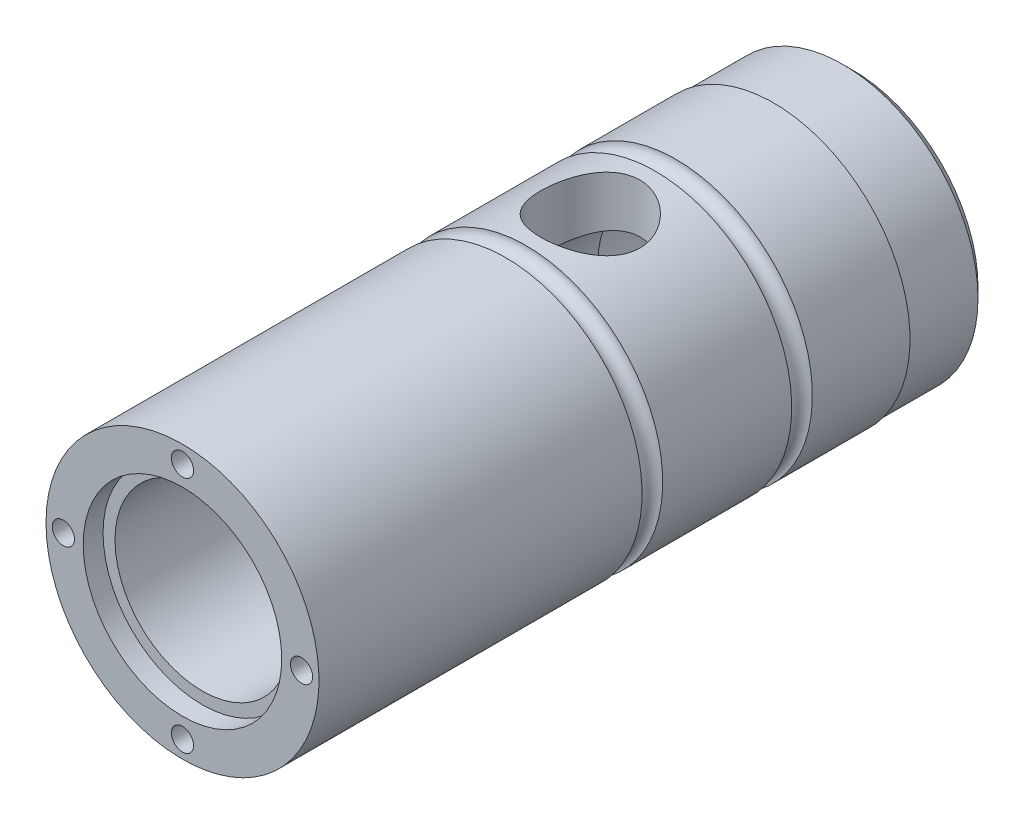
ISO-10303-21;
HEADER;
FILE_DESCRIPTION(('STEP AP214'),'2;1');
FILE_NAME('part.step','',(''),(''),'','','');
FILE_SCHEMA(('AUTOMOTIVE_DESIGN { 1 0 10303 214 1 1 1 1 }'));
ENDSEC;
DATA;
#1=APPLICATION_CONTEXT('core data for automotive mechanical design processes');
#2=APPLICATION_PROTOCOL_DEFINITION('international standard','automotive_design',2000,#1);
#3=PRODUCT_CONTEXT('',#1,'mechanical');
#4=PRODUCT('Part','Part','',(#3));
#5=PRODUCT_RELATED_PRODUCT_CATEGORY('part','',(#4));
#6=PRODUCT_DEFINITION_FORMATION('','',#4);
#7=PRODUCT_DEFINITION_CONTEXT('part definition',#1,'design');
#8=PRODUCT_DEFINITION('design','',#6,#7);
#9=PRODUCT_DEFINITION_SHAPE('','',#8);
#10=(LENGTH_UNIT() NAMED_UNIT(*) SI_UNIT(.MILLI.,.METRE.));
#11=(NAMED_UNIT(*) PLANE_ANGLE_UNIT() SI_UNIT($,.RADIAN.));
#12=(NAMED_UNIT(*) SI_UNIT($,.STERADIAN.) SOLID_ANGLE_UNIT());
#13=UNCERTAINTY_MEASURE_WITH_UNIT(LENGTH_MEASURE(1.E-05),#10,'distance_accuracy_value','');
#14=(GEOMETRIC_REPRESENTATION_CONTEXT(3) GLOBAL_UNCERTAINTY_ASSIGNED_CONTEXT((#13)) GLOBAL_UNIT_ASSIGNED_CONTEXT((#10,
#11,#12)) REPRESENTATION_CONTEXT('',''));
#15=CARTESIAN_POINT('',(0.,0.,0.));
#16=DIRECTION('',(0.,0.,1.));
#17=DIRECTION('',(1.,0.,0.));
#18=AXIS2_PLACEMENT_3D('',#15,#16,#17);
#19=CARTESIAN_POINT('',(0.,0.,0.));
#20=DIRECTION('',(0.,0.,1.));
#21=DIRECTION('',(1.,0.,0.));
#22=AXIS2_PLACEMENT_3D('',#19,#20,#21);
#23=CYLINDRICAL_SURFACE('',#22,8.9916);
#24=CARTESIAN_POINT('',(0.,0.,61.8235999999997));
#25=DIRECTION('',(0.,0.,1.));
#26=DIRECTION('',(1.,0.,0.));
#27=AXIS2_PLACEMENT_3D('',#24,#25,#26);
#28=CIRCLE('',#27,8.9916);
#29=CARTESIAN_POINT('',(8.9916,0.,61.8235999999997));
#30=VERTEX_POINT('',#29);
#31=EDGE_CURVE('E233',#30,#30,#28,.T.);
#32=CARTESIAN_POINT('',(0.,0.,57.5818));
#33=DIRECTION('',(0.,0.,-1.));
#34=DIRECTION('',(-1.,0.,0.));
#35=AXIS2_PLACEMENT_3D('',#32,#33,#34);
#36=CIRCLE('',#35,8.9916);
#37=CARTESIAN_POINT('',(8.9916,0.,57.5818));
#38=VERTEX_POINT('',#37);
#39=EDGE_CURVE('E12',#38,#38,#36,.F.);
#40=CARTESIAN_POINT('',(8.9916,0.,61.8235999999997));
#41=CARTESIAN_POINT('',(8.9916,0.,61.7794145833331));
#42=CARTESIAN_POINT('',(8.9916,0.,61.7352291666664));
#43=CARTESIAN_POINT('',(8.9916,0.,61.6468583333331));
#44=CARTESIAN_POINT('',(8.9916,0.,61.6026729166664));
#45=CARTESIAN_POINT('',(8.9916,0.,61.5143020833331));
#46=CARTESIAN_POINT('',(8.9916,0.,61.4701166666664));
#47=CARTESIAN_POINT('',(8.9916,0.,61.3817458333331));
#48=CARTESIAN_POINT('',(8.9916,0.,61.3375604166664));
#49=CARTESIAN_POINT('',(8.9916,0.,61.2491895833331));
#50=CARTESIAN_POINT('',(8.9916,0.,61.2050041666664));
#51=CARTESIAN_POINT('',(8.9916,0.,61.1166333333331));
#52=CARTESIAN_POINT('',(8.9916,0.,61.0724479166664));
#53=CARTESIAN_POINT('',(8.9916,0.,60.9840770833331));
#54=CARTESIAN_POINT('',(8.9916,0.,60.9398916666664));
#55=CARTESIAN_POINT('',(8.9916,0.,60.8515208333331));
#56=CARTESIAN_POINT('',(8.9916,0.,60.8073354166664));
#57=CARTESIAN_POINT('',(8.9916,0.,60.7189645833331));
#58=CARTESIAN_POINT('',(8.9916,0.,60.6747791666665));
#59=CARTESIAN_POINT('',(8.9916,0.,60.5864083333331));
#60=CARTESIAN_POINT('',(8.9916,0.,60.5422229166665));
#61=CARTESIAN_POINT('',(8.9916,0.,60.4538520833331));
#62=CARTESIAN_POINT('',(8.9916,0.,60.4096666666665));
#63=CARTESIAN_POINT('',(8.9916,0.,60.3212958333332));
#64=CARTESIAN_POINT('',(8.9916,0.,60.2771104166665));
#65=CARTESIAN_POINT('',(8.9916,0.,60.1887395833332));
#66=CARTESIAN_POINT('',(8.9916,0.,60.1445541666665));
#67=CARTESIAN_POINT('',(8.9916,0.,60.0561833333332));
#68=CARTESIAN_POINT('',(8.9916,0.,60.0119979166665));
#69=CARTESIAN_POINT('',(8.9916,0.,59.9236270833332));
#70=CARTESIAN_POINT('',(8.9916,0.,59.8794416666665));
#71=CARTESIAN_POINT('',(8.9916,0.,59.7910708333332));
#72=CARTESIAN_POINT('',(8.9916,0.,59.7468854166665));
#73=CARTESIAN_POINT('',(8.9916,0.,59.6585145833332));
#74=CARTESIAN_POINT('',(8.9916,0.,59.6143291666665));
#75=CARTESIAN_POINT('',(8.9916,0.,59.5259583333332));
#76=CARTESIAN_POINT('',(8.9916,0.,59.4817729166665));
#77=CARTESIAN_POINT('',(8.9916,0.,59.3934020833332));
#78=CARTESIAN_POINT('',(8.9916,0.,59.3492166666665));
#79=CARTESIAN_POINT('',(8.9916,0.,59.2608458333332));
#80=CARTESIAN_POINT('',(8.9916,0.,59.2166604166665));
#81=CARTESIAN_POINT('',(8.9916,0.,59.1282895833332));
#82=CARTESIAN_POINT('',(8.9916,0.,59.0841041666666));
#83=CARTESIAN_POINT('',(8.9916,0.,58.9957333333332));
#84=CARTESIAN_POINT('',(8.9916,0.,58.9515479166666));
#85=CARTESIAN_POINT('',(8.9916,0.,58.8631770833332));
#86=CARTESIAN_POINT('',(8.9916,0.,58.8189916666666));
#87=CARTESIAN_POINT('',(8.9916,0.,58.7306208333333));
#88=CARTESIAN_POINT('',(8.9916,0.,58.6864354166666));
#89=CARTESIAN_POINT('',(8.9916,0.,58.5980645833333));
#90=CARTESIAN_POINT('',(8.9916,0.,58.5538791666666));
#91=CARTESIAN_POINT('',(8.9916,0.,58.4655083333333));
#92=CARTESIAN_POINT('',(8.9916,0.,58.4213229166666));
#93=CARTESIAN_POINT('',(8.9916,0.,58.3329520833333));
#94=CARTESIAN_POINT('',(8.9916,0.,58.2887666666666));
#95=CARTESIAN_POINT('',(8.9916,0.,58.2003958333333));
#96=CARTESIAN_POINT('',(8.9916,0.,58.1562104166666));
#97=CARTESIAN_POINT('',(8.9916,0.,58.0678395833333));
#98=CARTESIAN_POINT('',(8.9916,0.,58.0236541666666));
#99=CARTESIAN_POINT('',(8.9916,0.,57.9352833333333));
#100=CARTESIAN_POINT('',(8.9916,0.,57.8910979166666));
#101=CARTESIAN_POINT('',(8.9916,0.,57.8027270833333));
#102=CARTESIAN_POINT('',(8.9916,0.,57.7585416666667));
#103=CARTESIAN_POINT('',(8.9916,0.,57.6701708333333));
#104=CARTESIAN_POINT('',(8.9916,0.,57.6259854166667));
#105=CARTESIAN_POINT('',(8.9916,0.,57.5818));
#106=B_SPLINE_CURVE_WITH_KNOTS('',3,(#40,#41,#42,#43,#44,#45,#46,#47,#48,#49,#50,#51,#52,#53,
#54,#55,#56,#57,#58,#59,#60,#61,#62,#63,#64,#65,#66,#67,#68,#69,#70,#71,#72,#73,#74,#75,#76,#77,
#78,#79,#80,#81,#82,#83,#84,#85,#86,#87,#88,#89,#90,#91,#92,#93,#94,#95,#96,#97,#98,#99,#100,
#101,#102,#103,#104,#105),.UNSPECIFIED.,.F.,.F.,(4,2,2,2,2,2,2,2,2,2,2,2,2,2,2,2,2,2,2,2,2,2,2,
2,2,2,2,2,2,2,2,2,4),(0.,0.132556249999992,0.265112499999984,0.397668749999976,
0.530224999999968,0.662781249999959,0.795337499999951,0.927893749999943,1.06044999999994,
1.19300624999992,1.32556249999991,1.4581187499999,1.5906749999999,1.72323124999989,
1.85578749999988,1.98834374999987,2.12089999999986,2.25345624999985,2.38601249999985,
2.51856874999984,2.65112499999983,2.78368124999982,2.91623749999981,3.04879374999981,
3.18134999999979,3.31390624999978,3.44646249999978,3.57901874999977,3.71157499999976,
3.84413124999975,3.97668749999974,4.10924374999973,4.24179999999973),.UNSPECIFIED.);
#107=EDGE_CURVE('BSEAM33',#30,#38,#106,.T.);
#108=ORIENTED_EDGE('',*,*,#31,.T.);
#109=ORIENTED_EDGE('',*,*,#39,.F.);
#110=ORIENTED_EDGE('',*,*,#107,.T.);
#111=ORIENTED_EDGE('',*,*,#107,.F.);
#112=EDGE_LOOP('',(#108,#110,#109,#111));
#113=FACE_BOUND('',#112,.T.);
#114=ADVANCED_FACE('F33',(#113),#23,.F.);
#115=CARTESIAN_POINT('',(0.,0.,36.0934000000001));
#116=DIRECTION('',(0.,0.,-1.));
#117=DIRECTION('',(-1.,0.,0.));
#118=AXIS2_PLACEMENT_3D('',#115,#116,#117);
#119=CONICAL_SURFACE('',#118,11.0109,0.256151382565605);
#120=CARTESIAN_POINT('',(-9.33116224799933,-5.84535511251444,36.0936000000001));
#121=CARTESIAN_POINT('',(-9.33491369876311,-5.88254688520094,36.0059393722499));
#122=CARTESIAN_POINT('',(-9.34006335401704,-5.91770885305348,35.917625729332));
#123=CARTESIAN_POINT('',(-9.35315907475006,-5.98397318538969,35.739692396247));
#124=CARTESIAN_POINT('',(-9.3611051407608,-6.01507554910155,35.6500727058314));
#125=CARTESIAN_POINT('',(-9.37044941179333,-6.04414810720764,35.5598));
#126=B_SPLINE_CURVE_WITH_KNOTS('',3,(#120,#121,#122,#123,#124,#125),.UNSPECIFIED.,.F.,.F.,(4,2,
4),(0.,0.285586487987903,0.571173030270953),.UNSPECIFIED.);
#127=CARTESIAN_POINT('',(-9.33117088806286,-5.84543998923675,36.0934000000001));
#128=VERTEX_POINT('',#127);
#129=CARTESIAN_POINT('',(-9.37042863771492,-6.04408367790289,35.56));
#130=VERTEX_POINT('',#129);
#131=EDGE_CURVE('E42',#128,#130,#126,.T.);
#132=ORIENTED_EDGE('',*,*,#131,.F.);
#133=CARTESIAN_POINT('',(0.,0.,36.0934000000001));
#134=DIRECTION('',(0.,0.,-1.));
#135=DIRECTION('',(-1.,0.,0.));
#136=AXIS2_PLACEMENT_3D('',#133,#134,#135);
#137=CIRCLE('',#136,11.0109);
#138=CARTESIAN_POINT('',(5.84543998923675,9.33117088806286,36.0934000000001));
#139=VERTEX_POINT('',#138);
#140=EDGE_CURVE('E86',#139,#128,#137,.T.);
#141=ORIENTED_EDGE('',*,*,#140,.F.);
#142=CARTESIAN_POINT('',(5.84535511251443,9.33116224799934,36.0936000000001));
#143=CARTESIAN_POINT('',(5.88254688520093,9.33491369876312,36.0059393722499));
#144=CARTESIAN_POINT('',(5.91770885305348,9.34006335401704,35.917625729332));
#145=CARTESIAN_POINT('',(5.98397318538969,9.35315907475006,35.739692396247));
#146=CARTESIAN_POINT('',(6.01507554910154,9.3611051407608,35.6500727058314));
#147=CARTESIAN_POINT('',(6.04414810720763,9.37044941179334,35.5598));
#148=B_SPLINE_CURVE_WITH_KNOTS('',3,(#142,#143,#144,#145,#146,#147),.UNSPECIFIED.,.F.,.F.,(4,2,
4),(0.,0.285586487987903,0.571173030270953),.UNSPECIFIED.);
#149=CARTESIAN_POINT('',(6.04408367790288,9.37042863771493,35.56));
#150=VERTEX_POINT('',#149);
#151=EDGE_CURVE('E81',#139,#150,#148,.T.);
#152=ORIENTED_EDGE('',*,*,#151,.T.);
#153=CARTESIAN_POINT('',(0.,0.,35.56));
#154=DIRECTION('',(0.,0.,-1.));
#155=DIRECTION('',(-1.,0.,0.));
#156=AXIS2_PLACEMENT_3D('',#153,#154,#155);
#157=CIRCLE('',#156,11.1506);
#158=EDGE_CURVE('E193',#150,#130,#157,.T.);
#159=ORIENTED_EDGE('',*,*,#158,.T.);
#160=EDGE_LOOP('',(#132,#141,#152,#159));
#161=FACE_BOUND('',#160,.T.);
#162=ADVANCED_FACE('F190',(#161),#119,.F.);
#163=CARTESIAN_POINT('',(0.,0.,85.8012));
#164=DIRECTION('',(0.,0.,-1.));
#165=DIRECTION('',(-1.,0.,0.));
#166=AXIS2_PLACEMENT_3D('',#163,#164,#165);
#167=CYLINDRICAL_SURFACE('',#166,17.4625);
#168=CARTESIAN_POINT('',(-17.4625,0.,39.962809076));
#169=CARTESIAN_POINT('',(-17.4625004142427,-0.172270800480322,39.9628096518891));
#170=CARTESIAN_POINT('',(-17.4599451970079,-0.344533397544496,39.9557932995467));
#171=CARTESIAN_POINT('',(-17.4497933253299,-0.687833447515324,39.9277954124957));
#172=CARTESIAN_POINT('',(-17.4421949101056,-0.858870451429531,39.9068090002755));
#173=CARTESIAN_POINT('',(-17.4221653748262,-1.19831377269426,39.8510871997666));
#174=CARTESIAN_POINT('',(-17.409736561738,-1.36672130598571,39.8163583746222));
#175=CARTESIAN_POINT('',(-17.3803726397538,-1.69986095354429,39.7334665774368));
#176=CARTESIAN_POINT('',(-17.3634357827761,-1.86459161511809,39.6852983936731));
#177=CARTESIAN_POINT('',(-17.3255457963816,-2.18882449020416,39.57609218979));
#178=CARTESIAN_POINT('',(-17.3046019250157,-2.3483377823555,39.5150838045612));
#179=CARTESIAN_POINT('',(-17.2592001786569,-2.6615733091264,39.3806153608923));
#180=CARTESIAN_POINT('',(-17.2347410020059,-2.81529337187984,39.3071506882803));
#181=CARTESIAN_POINT('',(-17.18293133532,-3.11593381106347,39.1483625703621));
#182=CARTESIAN_POINT('',(-17.155581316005,-3.26285528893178,39.0630410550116));
#183=CARTESIAN_POINT('',(-17.0986495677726,-3.54914086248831,38.8810988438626));
#184=CARTESIAN_POINT('',(-17.0690670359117,-3.68850220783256,38.7844740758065));
#185=CARTESIAN_POINT('',(-17.0073005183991,-3.9637408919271,38.5768834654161));
#186=CARTESIAN_POINT('',(-16.97506114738,-4.09931010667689,38.4655254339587));
#187=CARTESIAN_POINT('',(-16.9098063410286,-4.36067690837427,38.2320840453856));
#188=CARTESIAN_POINT('',(-16.8767908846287,-4.48647422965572,38.1100003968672));
#189=CARTESIAN_POINT('',(-16.8108355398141,-4.72761557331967,37.8557864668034));
#190=CARTESIAN_POINT('',(-16.7778956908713,-4.8429549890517,37.7236518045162));
#191=CARTESIAN_POINT('',(-16.7129983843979,-5.06237887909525,37.4501963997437));
#192=CARTESIAN_POINT('',(-16.6810405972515,-5.16646715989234,37.308878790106));
#193=CARTESIAN_POINT('',(-16.6178614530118,-5.36627992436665,37.0126028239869));
#194=CARTESIAN_POINT('',(-16.5867075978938,-5.46157064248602,36.8573370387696));
#195=CARTESIAN_POINT('',(-16.5273550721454,-5.63863108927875,36.5388176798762));
#196=CARTESIAN_POINT('',(-16.4991552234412,-5.72040621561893,36.3755673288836));
#197=CARTESIAN_POINT('',(-16.44660020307,-5.86979759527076,36.0420808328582));
#198=CARTESIAN_POINT('',(-16.4222455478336,-5.93741194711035,35.8718437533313));
#199=CARTESIAN_POINT('',(-16.3782199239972,-6.05779917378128,35.5256936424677));
#200=CARTESIAN_POINT('',(-16.358546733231,-6.11057909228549,35.3497833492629));
#201=CARTESIAN_POINT('',(-16.3252219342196,-6.19904698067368,35.0004397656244));
#202=CARTESIAN_POINT('',(-16.3113671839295,-6.23531612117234,34.8271730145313));
#203=CARTESIAN_POINT('',(-16.289092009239,-6.29327858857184,34.4779437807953));
#204=CARTESIAN_POINT('',(-16.2806692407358,-6.31497820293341,34.3019824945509));
#205=CARTESIAN_POINT('',(-16.2695440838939,-6.34358559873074,33.948702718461));
#206=CARTESIAN_POINT('',(-16.2668409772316,-6.35049523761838,33.7713844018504));
#207=CARTESIAN_POINT('',(-16.2672492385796,-6.34944959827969,33.4168016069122));
#208=CARTESIAN_POINT('',(-16.2703603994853,-6.34149484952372,33.2395371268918));
#209=CARTESIAN_POINT('',(-16.2819508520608,-6.31167308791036,32.8963842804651));
#210=CARTESIAN_POINT('',(-16.290119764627,-6.29061012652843,32.7304147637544));
#211=CARTESIAN_POINT('',(-16.3112872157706,-6.23551808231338,32.4008987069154));
#212=CARTESIAN_POINT('',(-16.3242873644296,-6.20148467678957,32.2373529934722));
#213=CARTESIAN_POINT('',(-16.35471878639,-6.12077899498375,31.9138842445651));
#214=CARTESIAN_POINT('',(-16.3721488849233,-6.0741100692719,31.7539602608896));
#215=CARTESIAN_POINT('',(-16.41093905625,-5.96851298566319,31.4386404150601));
#216=CARTESIAN_POINT('',(-16.4323006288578,-5.90958014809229,31.2832463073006));
#217=CARTESIAN_POINT('',(-16.4787597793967,-5.77877855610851,30.9752520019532));
#218=CARTESIAN_POINT('',(-16.5039170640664,-5.70669830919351,30.8227506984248));
#219=CARTESIAN_POINT('',(-16.5569866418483,-5.55084454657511,30.5242852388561));
#220=CARTESIAN_POINT('',(-16.5848998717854,-5.46706705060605,30.3783233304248));
#221=CARTESIAN_POINT('',(-16.6427344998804,-5.28839384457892,30.0937727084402));
#222=CARTESIAN_POINT('',(-16.6726561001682,-5.193497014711,29.9551847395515));
#223=CARTESIAN_POINT('',(-16.733740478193,-4.99317529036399,29.6861267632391));
#224=CARTESIAN_POINT('',(-16.7649033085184,-4.88774994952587,29.5556571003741));
#225=CARTESIAN_POINT('',(-16.8296818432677,-4.65999980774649,29.2955604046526));
#226=CARTESIAN_POINT('',(-16.8633282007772,-4.53702830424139,29.1665065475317));
#227=CARTESIAN_POINT('',(-16.9302210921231,-4.28066137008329,28.9191800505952));
#228=CARTESIAN_POINT('',(-16.9634677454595,-4.14726914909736,28.8009041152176));
#229=CARTESIAN_POINT('',(-17.0286932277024,-3.87074914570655,28.5757860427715));
#230=CARTESIAN_POINT('',(-17.0606713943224,-3.7276163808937,28.4689498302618));
#231=CARTESIAN_POINT('',(-17.1224673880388,-3.43259646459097,28.2675619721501));
#232=CARTESIAN_POINT('',(-17.152286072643,-3.28071283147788,28.1730054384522));
#233=CARTESIAN_POINT('',(-17.2093711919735,-2.96685789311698,27.9955847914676));
#234=CARTESIAN_POINT('',(-17.2365952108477,-2.8047736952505,27.9129064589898));
#235=CARTESIAN_POINT('',(-17.2872177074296,-2.47366988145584,27.7616064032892));
#236=CARTESIAN_POINT('',(-17.3106176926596,-2.30465303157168,27.6929791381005));
#237=CARTESIAN_POINT('',(-17.3529230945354,-1.96085574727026,27.5703886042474));
#238=CARTESIAN_POINT('',(-17.3718291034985,-1.78607607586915,27.5164234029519));
#239=CARTESIAN_POINT('',(-17.4045878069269,-1.43206809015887,27.4236932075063));
#240=CARTESIAN_POINT('',(-17.4184407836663,-1.25284002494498,27.3849273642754));
#241=CARTESIAN_POINT('',(-17.4401139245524,-0.900499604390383,27.3245726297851));
#242=CARTESIAN_POINT('',(-17.4482032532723,-0.727535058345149,27.3022156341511));
#243=CARTESIAN_POINT('',(-17.4592252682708,-0.380191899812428,27.2718041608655));
#244=CARTESIAN_POINT('',(-17.4621581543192,-0.205813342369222,27.2637491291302));
#245=CARTESIAN_POINT('',(-17.4627853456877,0.142991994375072,27.2620243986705));
#246=CARTESIAN_POINT('',(-17.4604805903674,0.317418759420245,27.2683521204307));
#247=CARTESIAN_POINT('',(-17.4506988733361,0.665013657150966,27.2953220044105));
#248=CARTESIAN_POINT('',(-17.4432219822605,0.838181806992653,27.3159639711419));
#249=CARTESIAN_POINT('',(-17.4236626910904,1.17577348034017,27.3703550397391));
#250=CARTESIAN_POINT('',(-17.411755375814,1.34028767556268,27.4036066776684));
#251=CARTESIAN_POINT('',(-17.3836266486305,1.66587512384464,27.4829278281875));
#252=CARTESIAN_POINT('',(-17.3674038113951,1.82694722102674,27.5290015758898));
#253=CARTESIAN_POINT('',(-17.3310568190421,2.14450778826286,27.6335512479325));
#254=CARTESIAN_POINT('',(-17.3109337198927,2.30099748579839,27.6920238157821));
#255=CARTESIAN_POINT('',(-17.2672685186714,2.60853965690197,27.8209325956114));
#256=CARTESIAN_POINT('',(-17.2437251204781,2.7595900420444,27.8913733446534));
#257=CARTESIAN_POINT('',(-17.1930831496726,3.05950604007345,28.0458373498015));
#258=CARTESIAN_POINT('',(-17.1659028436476,3.20818895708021,28.1301884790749));
#259=CARTESIAN_POINT('',(-17.1091985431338,3.49800593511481,28.3103960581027));
#260=CARTESIAN_POINT('',(-17.079673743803,3.63913737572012,28.4062564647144));
#261=CARTESIAN_POINT('',(-17.0190116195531,3.91303327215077,28.6088416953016));
#262=CARTESIAN_POINT('',(-16.9878740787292,4.04579660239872,28.7155679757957));
#263=CARTESIAN_POINT('',(-16.9247535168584,4.30221600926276,28.9392254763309));
#264=CARTESIAN_POINT('',(-16.8927704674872,4.42587178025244,29.0561570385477));
#265=CARTESIAN_POINT('',(-16.8269950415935,4.6699011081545,29.3062223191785));
#266=CARTESIAN_POINT('',(-16.7931994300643,4.78972475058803,29.4398925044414));
#267=CARTESIAN_POINT('',(-16.7265001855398,5.01768890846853,29.7169811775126));
#268=CARTESIAN_POINT('',(-16.6935962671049,5.12583319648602,29.8603964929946));
#269=CARTESIAN_POINT('',(-16.6295977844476,5.32980467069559,30.1562247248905));
#270=CARTESIAN_POINT('',(-16.5985040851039,5.42562599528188,30.3086418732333));
#271=CARTESIAN_POINT('',(-16.5390844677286,5.60414507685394,30.6214103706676));
#272=CARTESIAN_POINT('',(-16.5107573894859,5.68684834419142,30.781758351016));
#273=CARTESIAN_POINT('',(-16.4576723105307,5.83870015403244,31.109843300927));
#274=CARTESIAN_POINT('',(-16.432923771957,5.90781292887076,31.2775983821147));
#275=CARTESIAN_POINT('',(-16.3879093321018,6.03155637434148,31.6188789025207));
#276=CARTESIAN_POINT('',(-16.3676415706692,6.0861930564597,31.7924019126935));
#277=CARTESIAN_POINT('',(-16.3322804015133,6.18045799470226,32.1439500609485));
#278=CARTESIAN_POINT('',(-16.3171856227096,6.22009022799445,32.3219739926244));
#279=CARTESIAN_POINT('',(-16.29270705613,6.28393010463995,32.6811510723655));
#280=CARTESIAN_POINT('',(-16.2833229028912,6.30813873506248,32.8623040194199));
#281=CARTESIAN_POINT('',(-16.2709968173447,6.33986088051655,33.2151729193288));
#282=CARTESIAN_POINT('',(-16.267698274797,6.3482989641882,33.3867939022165));
#283=CARTESIAN_POINT('',(-16.26655183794,6.35123624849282,33.730171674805));
#284=CARTESIAN_POINT('',(-16.2687037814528,6.34573586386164,33.9019284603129));
#285=CARTESIAN_POINT('',(-16.2783863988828,6.32085585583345,34.2442624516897));
#286=CARTESIAN_POINT('',(-16.2859165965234,6.30147746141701,34.414839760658));
#287=CARTESIAN_POINT('',(-16.3061078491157,6.24904314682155,34.7535682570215));
#288=CARTESIAN_POINT('',(-16.318768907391,6.21598721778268,34.9217194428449));
#289=CARTESIAN_POINT('',(-16.3484062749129,6.13760708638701,35.2498670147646));
#290=CARTESIAN_POINT('',(-16.3652557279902,6.0926413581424,35.4099607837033));
#291=CARTESIAN_POINT('',(-16.4029380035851,5.99045032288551,35.7257590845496));
#292=CARTESIAN_POINT('',(-16.4237721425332,5.93322096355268,35.8814621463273));
#293=CARTESIAN_POINT('',(-16.4688310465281,5.80697837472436,36.1874729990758));
#294=CARTESIAN_POINT('',(-16.4930552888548,5.73796696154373,36.3377816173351));
#295=CARTESIAN_POINT('',(-16.5442543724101,5.58862985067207,36.6322429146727));
#296=CARTESIAN_POINT('',(-16.5712302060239,5.50830006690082,36.7763933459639));
#297=CARTESIAN_POINT('',(-16.62863001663,5.33259132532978,37.0647475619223));
#298=CARTESIAN_POINT('',(-16.6591588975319,5.23666132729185,37.2085948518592));
#299=CARTESIAN_POINT('',(-16.7216453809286,5.03356411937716,37.4877976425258));
#300=CARTESIAN_POINT('',(-16.7536030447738,4.92639642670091,37.6231527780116));
#301=CARTESIAN_POINT('',(-16.8181197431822,4.70143064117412,37.8846719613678));
#302=CARTESIAN_POINT('',(-16.8506790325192,4.58362795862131,38.0108319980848));
#303=CARTESIAN_POINT('',(-16.9155385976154,4.33815280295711,38.2531393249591));
#304=CARTESIAN_POINT('',(-16.9478389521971,4.21048346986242,38.3692897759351));
#305=CARTESIAN_POINT('',(-17.012967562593,3.93931970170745,38.596491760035));
#306=CARTESIAN_POINT('',(-17.0457411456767,3.79535282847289,38.7069960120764));
#307=CARTESIAN_POINT('',(-17.1091888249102,3.49823227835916,38.9154301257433));
#308=CARTESIAN_POINT('',(-17.1398637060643,3.34508207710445,39.0133647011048));
#309=CARTESIAN_POINT('',(-17.1982815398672,3.03044974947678,39.1959957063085));
#310=CARTESIAN_POINT('',(-17.226023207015,2.86896401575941,39.2806863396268));
#311=CARTESIAN_POINT('',(-17.2777572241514,2.53887852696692,39.4360257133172));
#312=CARTESIAN_POINT('',(-17.3017511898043,2.3702818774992,39.5066805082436));
#313=CARTESIAN_POINT('',(-17.3457089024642,2.02393524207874,39.6345101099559));
#314=CARTESIAN_POINT('',(-17.3655899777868,1.84607368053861,39.6914116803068));
#315=CARTESIAN_POINT('',(-17.4001393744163,1.48554568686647,39.7894221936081));
#316=CARTESIAN_POINT('',(-17.4148075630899,1.30287913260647,39.8305307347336));
#317=CARTESIAN_POINT('',(-17.4384634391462,0.934334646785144,39.8964823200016));
#318=CARTESIAN_POINT('',(-17.4474531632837,0.74845789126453,39.9213311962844));
#319=CARTESIAN_POINT('',(-17.4594709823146,0.375050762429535,39.9544936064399));
#320=CARTESIAN_POINT('',(-17.4624995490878,0.187520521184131,39.9628084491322));
#321=CARTESIAN_POINT('',(-17.4625,0.,39.962809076));
#322=B_SPLINE_CURVE_WITH_KNOTS('',3,(#168,#169,#170,#171,#172,#173,#174,#175,#176,#177,#178,
#179,#180,#181,#182,#183,#184,#185,#186,#187,#188,#189,#190,#191,#192,#193,#194,#195,#196,#197,
#198,#199,#200,#201,#202,#203,#204,#205,#206,#207,#208,#209,#210,#211,#212,#213,#214,#215,#216,
#217,#218,#219,#220,#221,#222,#223,#224,#225,#226,#227,#228,#229,#230,#231,#232,#233,#234,#235,
#236,#237,#238,#239,#240,#241,#242,#243,#244,#245,#246,#247,#248,#249,#250,#251,#252,#253,#254,
#255,#256,#257,#258,#259,#260,#261,#262,#263,#264,#265,#266,#267,#268,#269,#270,#271,#272,#273,
#274,#275,#276,#277,#278,#279,#280,#281,#282,#283,#284,#285,#286,#287,#288,#289,#290,#291,#292,
#293,#294,#295,#296,#297,#298,#299,#300,#301,#302,#303,#304,#305,#306,#307,#308,#309,#310,#311,
#312,#313,#314,#315,#316,#317,#318,#319,#320,#321),.UNSPECIFIED.,.T.,.F.,(4,2,2,2,2,2,2,2,2,2,2,
2,2,2,2,2,2,2,2,2,2,2,2,2,2,2,2,2,2,2,2,2,2,2,2,2,2,2,2,2,2,2,2,2,2,2,2,2,2,2,2,2,2,2,2,2,2,2,2,
2,2,2,2,2,2,2,2,2,2,2,2,2,2,2,2,2,4),(0.,0.51663731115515,1.03345509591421,1.55002635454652,
2.06679821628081,2.58239020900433,3.09817361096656,3.61387315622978,4.12975906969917,
4.66429641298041,5.19884828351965,5.73363448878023,6.26823919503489,6.82201443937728,
7.37556798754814,7.92919581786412,8.48256032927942,9.01456236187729,9.54633466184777,
10.0780401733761,10.6097267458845,11.1116382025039,11.6137170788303,12.1156629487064,
12.6178007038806,13.1288721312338,13.6401178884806,14.1514151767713,14.662734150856,
15.20633290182,15.7497648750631,16.2934769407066,16.8369719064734,17.3882102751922,
17.9392308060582,18.4901786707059,19.0410957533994,19.5642110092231,20.087305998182,
20.6103071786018,21.1333012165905,21.6375085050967,22.1418825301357,22.6461201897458,
23.1505494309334,23.6692489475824,24.18812730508,24.707075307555,25.2260407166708,
25.77340551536,26.3205929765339,26.8680397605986,27.4152559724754,27.9638936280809,
28.5123030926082,29.0605670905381,29.6087959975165,30.1237325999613,30.638653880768,
31.1535295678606,31.6684055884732,32.1692652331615,32.670290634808,33.1712388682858,
33.6723684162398,34.1985120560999,34.7246783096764,35.2510727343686,35.7773003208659,
36.3299009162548,36.8822936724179,37.4349275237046,37.9873224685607,38.5499255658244,
39.112542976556,39.6749584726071,40.2373294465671),.UNSPECIFIED.);
#323=CARTESIAN_POINT('',(-17.4625,0.,39.962809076));
#324=VERTEX_POINT('',#323);
#325=EDGE_CURVE('E176',#324,#324,#322,.T.);
#326=ORIENTED_EDGE('',*,*,#325,.T.);
#327=EDGE_LOOP('',(#326));
#328=FACE_BOUND('',#327,.T.);
#329=CARTESIAN_POINT('',(0.,0.,25.2984));
#330=DIRECTION('',(0.,0.,-1.));
#331=DIRECTION('',(-1.,0.,0.));
#332=AXIS2_PLACEMENT_3D('',#329,#330,#331);
#333=CIRCLE('',#332,17.4625);
#334=CARTESIAN_POINT('',(-17.4625,0.,25.2984));
#335=VERTEX_POINT('',#334);
#336=EDGE_CURVE('E314',#335,#335,#333,.T.);
#337=ORIENTED_EDGE('',*,*,#336,.F.);
#338=EDGE_LOOP('',(#337));
#339=FACE_BOUND('',#338,.T.);
#340=CARTESIAN_POINT('',(0.,0.,41.8084));
#341=DIRECTION('',(0.,0.,-1.));
#342=DIRECTION('',(-1.,0.,0.));
#343=AXIS2_PLACEMENT_3D('',#340,#341,#342);
#344=CIRCLE('',#343,17.4625);
#345=CARTESIAN_POINT('',(-17.4625,0.,41.8084));
#346=VERTEX_POINT('',#345);
#347=EDGE_CURVE('E318',#346,#346,#344,.T.);
#348=ORIENTED_EDGE('',*,*,#347,.T.);
#349=EDGE_LOOP('',(#348));
#350=FACE_BOUND('',#349,.T.);
#351=CARTESIAN_POINT('',(0.,17.4625,27.262809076));
#352=CARTESIAN_POINT('',(-0.172270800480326,17.4625004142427,27.2628085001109));
#353=CARTESIAN_POINT('',(-0.3445333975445,17.4599451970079,27.2698248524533));
#354=CARTESIAN_POINT('',(-0.687833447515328,17.4497933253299,27.2978227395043));
#355=CARTESIAN_POINT('',(-0.858870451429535,17.4421949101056,27.3188091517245));
#356=CARTESIAN_POINT('',(-1.19831377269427,17.4221653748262,27.3745309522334));
#357=CARTESIAN_POINT('',(-1.36672130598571,17.409736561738,27.4092597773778));
#358=CARTESIAN_POINT('',(-1.6998609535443,17.3803726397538,27.4921515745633));
#359=CARTESIAN_POINT('',(-1.86459161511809,17.3634357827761,27.5403197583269));
#360=CARTESIAN_POINT('',(-2.18882449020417,17.3255457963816,27.64952596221));
#361=CARTESIAN_POINT('',(-2.3483377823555,17.3046019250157,27.7105343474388));
#362=CARTESIAN_POINT('',(-2.66157330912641,17.2592001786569,27.8450027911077));
#363=CARTESIAN_POINT('',(-2.81529337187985,17.2347410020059,27.9184674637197));
#364=CARTESIAN_POINT('',(-3.11593381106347,17.18293133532,28.0772555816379));
#365=CARTESIAN_POINT('',(-3.26285528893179,17.155581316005,28.1625770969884));
#366=CARTESIAN_POINT('',(-3.54914086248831,17.0986495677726,28.3445193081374));
#367=CARTESIAN_POINT('',(-3.68850220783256,17.0690670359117,28.4411440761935));
#368=CARTESIAN_POINT('',(-3.96374089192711,17.0073005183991,28.6487346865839));
#369=CARTESIAN_POINT('',(-4.09931010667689,16.97506114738,28.7600927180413));
#370=CARTESIAN_POINT('',(-4.36067690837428,16.9098063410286,28.9935341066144));
#371=CARTESIAN_POINT('',(-4.48647422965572,16.8767908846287,29.1156177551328));
#372=CARTESIAN_POINT('',(-4.72761557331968,16.8108355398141,29.3698316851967));
#373=CARTESIAN_POINT('',(-4.84295498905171,16.7778956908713,29.5019663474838));
#374=CARTESIAN_POINT('',(-5.06237887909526,16.7129983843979,29.7754217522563));
#375=CARTESIAN_POINT('',(-5.16646715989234,16.6810405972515,29.916739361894));
#376=CARTESIAN_POINT('',(-5.36627992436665,16.6178614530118,30.2130153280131));
#377=CARTESIAN_POINT('',(-5.46157064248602,16.5867075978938,30.3682811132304));
#378=CARTESIAN_POINT('',(-5.63863108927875,16.5273550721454,30.6868004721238));
#379=CARTESIAN_POINT('',(-5.72040621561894,16.4991552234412,30.8500508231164));
#380=CARTESIAN_POINT('',(-5.86979759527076,16.44660020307,31.1835373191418));
#381=CARTESIAN_POINT('',(-5.93741194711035,16.4222455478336,31.3537743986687));
#382=CARTESIAN_POINT('',(-6.05779917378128,16.3782199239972,31.6999245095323));
#383=CARTESIAN_POINT('',(-6.11057909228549,16.358546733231,31.8758348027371));
#384=CARTESIAN_POINT('',(-6.19904698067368,16.3252219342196,32.2251783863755));
#385=CARTESIAN_POINT('',(-6.23531612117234,16.3113671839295,32.3984451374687));
#386=CARTESIAN_POINT('',(-6.29327858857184,16.289092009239,32.7476743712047));
#387=CARTESIAN_POINT('',(-6.31497820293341,16.2806692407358,32.9236356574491));
#388=CARTESIAN_POINT('',(-6.34358559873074,16.2695440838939,33.2769154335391));
#389=CARTESIAN_POINT('',(-6.35049523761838,16.2668409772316,33.4542337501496));
#390=CARTESIAN_POINT('',(-6.34944959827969,16.2672492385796,33.8088165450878));
#391=CARTESIAN_POINT('',(-6.34149484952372,16.2703603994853,33.9860810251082));
#392=CARTESIAN_POINT('',(-6.31167308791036,16.2819508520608,34.3292338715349));
#393=CARTESIAN_POINT('',(-6.29061012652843,16.290119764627,34.4952033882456));
#394=CARTESIAN_POINT('',(-6.23551808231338,16.3112872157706,34.8247194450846));
#395=CARTESIAN_POINT('',(-6.20148467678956,16.3242873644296,34.9882651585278));
#396=CARTESIAN_POINT('',(-6.12077899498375,16.35471878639,35.311733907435));
#397=CARTESIAN_POINT('',(-6.0741100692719,16.3721488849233,35.4716578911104));
#398=CARTESIAN_POINT('',(-5.96851298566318,16.41093905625,35.7869777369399));
#399=CARTESIAN_POINT('',(-5.90958014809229,16.4323006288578,35.9423718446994));
#400=CARTESIAN_POINT('',(-5.77877855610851,16.4787597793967,36.2503661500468));
#401=CARTESIAN_POINT('',(-5.70669830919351,16.5039170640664,36.4028674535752));
#402=CARTESIAN_POINT('',(-5.55084454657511,16.5569866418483,36.7013329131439));
#403=CARTESIAN_POINT('',(-5.46706705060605,16.5848998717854,36.8472948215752));
#404=CARTESIAN_POINT('',(-5.28839384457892,16.6427344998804,37.1318454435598));
#405=CARTESIAN_POINT('',(-5.193497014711,16.6726561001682,37.2704334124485));
#406=CARTESIAN_POINT('',(-4.99317529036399,16.733740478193,37.5394913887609));
#407=CARTESIAN_POINT('',(-4.88774994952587,16.7649033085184,37.6699610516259));
#408=CARTESIAN_POINT('',(-4.65999980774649,16.8296818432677,37.9300577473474));
#409=CARTESIAN_POINT('',(-4.53702830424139,16.8633282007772,38.0591116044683));
#410=CARTESIAN_POINT('',(-4.28066137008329,16.9302210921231,38.3064381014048));
#411=CARTESIAN_POINT('',(-4.14726914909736,16.9634677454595,38.4247140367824));
#412=CARTESIAN_POINT('',(-3.87074914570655,17.0286932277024,38.6498321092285));
#413=CARTESIAN_POINT('',(-3.7276163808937,17.0606713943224,38.7566683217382));
#414=CARTESIAN_POINT('',(-3.43259646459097,17.1224673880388,38.9580561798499));
#415=CARTESIAN_POINT('',(-3.28071283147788,17.152286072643,39.0526127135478));
#416=CARTESIAN_POINT('',(-2.96685789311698,17.2093711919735,39.2300333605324));
#417=CARTESIAN_POINT('',(-2.8047736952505,17.2365952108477,39.3127116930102));
#418=CARTESIAN_POINT('',(-2.47366988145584,17.2872177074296,39.4640117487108));
#419=CARTESIAN_POINT('',(-2.30465303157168,17.3106176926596,39.5326390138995));
#420=CARTESIAN_POINT('',(-1.96085574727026,17.3529230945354,39.6552295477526));
#421=CARTESIAN_POINT('',(-1.78607607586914,17.3718291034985,39.7091947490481));
#422=CARTESIAN_POINT('',(-1.43206809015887,17.4045878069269,39.8019249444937));
#423=CARTESIAN_POINT('',(-1.25284002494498,17.4184407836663,39.8406907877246));
#424=CARTESIAN_POINT('',(-0.900499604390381,17.4401139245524,39.9010455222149));
#425=CARTESIAN_POINT('',(-0.727535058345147,17.4482032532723,39.9234025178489));
#426=CARTESIAN_POINT('',(-0.380191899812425,17.4592252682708,39.9538139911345));
#427=CARTESIAN_POINT('',(-0.20581334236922,17.4621581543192,39.9618690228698));
#428=CARTESIAN_POINT('',(0.142991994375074,17.4627853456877,39.9635937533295));
#429=CARTESIAN_POINT('',(0.317418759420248,17.4604805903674,39.9572660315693));
#430=CARTESIAN_POINT('',(0.665013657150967,17.4506988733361,39.9302961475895));
#431=CARTESIAN_POINT('',(0.838181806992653,17.4432219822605,39.9096541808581));
#432=CARTESIAN_POINT('',(1.17577348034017,17.4236626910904,39.8552631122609));
#433=CARTESIAN_POINT('',(1.34028767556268,17.411755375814,39.8220114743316));
#434=CARTESIAN_POINT('',(1.66587512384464,17.3836266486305,39.7426903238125));
#435=CARTESIAN_POINT('',(1.82694722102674,17.3674038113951,39.6966165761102));
#436=CARTESIAN_POINT('',(2.14450778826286,17.3310568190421,39.5920669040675));
#437=CARTESIAN_POINT('',(2.30099748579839,17.3109337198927,39.5335943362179));
#438=CARTESIAN_POINT('',(2.60853965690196,17.2672685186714,39.4046855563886));
#439=CARTESIAN_POINT('',(2.7595900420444,17.2437251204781,39.3342448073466));
#440=CARTESIAN_POINT('',(3.05950604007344,17.1930831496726,39.1797808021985));
#441=CARTESIAN_POINT('',(3.2081889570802,17.1659028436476,39.0954296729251));
#442=CARTESIAN_POINT('',(3.4980059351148,17.1091985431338,38.9152220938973));
#443=CARTESIAN_POINT('',(3.63913737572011,17.079673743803,38.8193616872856));
#444=CARTESIAN_POINT('',(3.91303327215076,17.0190116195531,38.6167764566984));
#445=CARTESIAN_POINT('',(4.04579660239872,16.9878740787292,38.5100501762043));
#446=CARTESIAN_POINT('',(4.30221600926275,16.9247535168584,38.2863926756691));
#447=CARTESIAN_POINT('',(4.42587178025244,16.8927704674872,38.1694611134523));
#448=CARTESIAN_POINT('',(4.6699011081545,16.8269950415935,37.9193958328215));
#449=CARTESIAN_POINT('',(4.78972475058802,16.7931994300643,37.7857256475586));
#450=CARTESIAN_POINT('',(5.01768890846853,16.7265001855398,37.5086369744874));
#451=CARTESIAN_POINT('',(5.12583319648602,16.6935962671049,37.3652216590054));
#452=CARTESIAN_POINT('',(5.32980467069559,16.6295977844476,37.0693934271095));
#453=CARTESIAN_POINT('',(5.42562599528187,16.5985040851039,36.9169762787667));
#454=CARTESIAN_POINT('',(5.60414507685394,16.5390844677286,36.6042077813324));
#455=CARTESIAN_POINT('',(5.68684834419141,16.5107573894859,36.443859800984));
#456=CARTESIAN_POINT('',(5.83870015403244,16.4576723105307,36.115774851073));
#457=CARTESIAN_POINT('',(5.90781292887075,16.432923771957,35.9480197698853));
#458=CARTESIAN_POINT('',(6.03155637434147,16.3879093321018,35.6067392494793));
#459=CARTESIAN_POINT('',(6.08619305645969,16.3676415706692,35.4332162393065));
#460=CARTESIAN_POINT('',(6.18045799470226,16.3322804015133,35.0816680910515));
#461=CARTESIAN_POINT('',(6.22009022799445,16.3171856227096,34.9036441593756));
#462=CARTESIAN_POINT('',(6.28393010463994,16.29270705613,34.5444670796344));
#463=CARTESIAN_POINT('',(6.30813873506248,16.2833229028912,34.3633141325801));
#464=CARTESIAN_POINT('',(6.33986088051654,16.2709968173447,34.0104452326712));
#465=CARTESIAN_POINT('',(6.34829896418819,16.267698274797,33.8388242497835));
#466=CARTESIAN_POINT('',(6.35123624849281,16.26655183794,33.495446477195));
#467=CARTESIAN_POINT('',(6.34573586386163,16.2687037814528,33.3236896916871));
#468=CARTESIAN_POINT('',(6.32085585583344,16.2783863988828,32.9813557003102));
#469=CARTESIAN_POINT('',(6.301477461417,16.2859165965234,32.8107783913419));
#470=CARTESIAN_POINT('',(6.24904314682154,16.3061078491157,32.4720498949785));
#471=CARTESIAN_POINT('',(6.21598721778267,16.318768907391,32.303898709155));
#472=CARTESIAN_POINT('',(6.137607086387,16.3484062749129,31.9757511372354));
#473=CARTESIAN_POINT('',(6.09264135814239,16.3652557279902,31.8156573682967));
#474=CARTESIAN_POINT('',(5.9904503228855,16.4029380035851,31.4998590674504));
#475=CARTESIAN_POINT('',(5.93322096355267,16.4237721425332,31.3441560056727));
#476=CARTESIAN_POINT('',(5.80697837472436,16.4688310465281,31.0381451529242));
#477=CARTESIAN_POINT('',(5.73796696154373,16.4930552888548,30.8878365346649));
#478=CARTESIAN_POINT('',(5.58862985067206,16.5442543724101,30.5933752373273));
#479=CARTESIAN_POINT('',(5.50830006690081,16.5712302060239,30.4492248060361));
#480=CARTESIAN_POINT('',(5.33259132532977,16.62863001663,30.1608705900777));
#481=CARTESIAN_POINT('',(5.23666132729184,16.6591588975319,30.0170233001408));
#482=CARTESIAN_POINT('',(5.03356411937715,16.7216453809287,29.7378205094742));
#483=CARTESIAN_POINT('',(4.9263964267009,16.7536030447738,29.6024653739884));
#484=CARTESIAN_POINT('',(4.70143064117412,16.8181197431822,29.3409461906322));
#485=CARTESIAN_POINT('',(4.58362795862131,16.8506790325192,29.2147861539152));
#486=CARTESIAN_POINT('',(4.33815280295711,16.9155385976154,28.972478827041));
#487=CARTESIAN_POINT('',(4.21048346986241,16.9478389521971,28.8563283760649));
#488=CARTESIAN_POINT('',(3.93931970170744,17.012967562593,28.629126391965));
#489=CARTESIAN_POINT('',(3.79535282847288,17.0457411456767,28.5186221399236));
#490=CARTESIAN_POINT('',(3.49823227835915,17.1091888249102,28.3101880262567));
#491=CARTESIAN_POINT('',(3.34508207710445,17.1398637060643,28.2122534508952));
#492=CARTESIAN_POINT('',(3.03044974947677,17.1982815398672,28.0296224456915));
#493=CARTESIAN_POINT('',(2.8689640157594,17.226023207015,27.9449318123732));
#494=CARTESIAN_POINT('',(2.53887852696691,17.2777572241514,27.7895924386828));
#495=CARTESIAN_POINT('',(2.37028187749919,17.3017511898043,27.7189376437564));
#496=CARTESIAN_POINT('',(2.02393524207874,17.3457089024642,27.5911080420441));
#497=CARTESIAN_POINT('',(1.8460736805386,17.3655899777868,27.5342064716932));
#498=CARTESIAN_POINT('',(1.48554568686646,17.4001393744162,27.4361959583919));
#499=CARTESIAN_POINT('',(1.30287913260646,17.4148075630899,27.3950874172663));
#500=CARTESIAN_POINT('',(0.934334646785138,17.4384634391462,27.3291358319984));
#501=CARTESIAN_POINT('',(0.748457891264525,17.4474531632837,27.3042869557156));
#502=CARTESIAN_POINT('',(0.375050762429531,17.4594709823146,27.2711245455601));
#503=CARTESIAN_POINT('',(0.187520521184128,17.4624995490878,27.2628097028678));
#504=CARTESIAN_POINT('',(0.,17.4625,27.262809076));
#505=B_SPLINE_CURVE_WITH_KNOTS('',3,(#351,#352,#353,#354,#355,#356,#357,#358,#359,#360,#361,
#362,#363,#364,#365,#366,#367,#368,#369,#370,#371,#372,#373,#374,#375,#376,#377,#378,#379,#380,
#381,#382,#383,#384,#385,#386,#387,#388,#389,#390,#391,#392,#393,#394,#395,#396,#397,#398,#399,
#400,#401,#402,#403,#404,#405,#406,#407,#408,#409,#410,#411,#412,#413,#414,#415,#416,#417,#418,
#419,#420,#421,#422,#423,#424,#425,#426,#427,#428,#429,#430,#431,#432,#433,#434,#435,#436,#437,
#438,#439,#440,#441,#442,#443,#444,#445,#446,#447,#448,#449,#450,#451,#452,#453,#454,#455,#456,
#457,#458,#459,#460,#461,#462,#463,#464,#465,#466,#467,#468,#469,#470,#471,#472,#473,#474,#475,
#476,#477,#478,#479,#480,#481,#482,#483,#484,#485,#486,#487,#488,#489,#490,#491,#492,#493,#494,
#495,#496,#497,#498,#499,#500,#501,#502,#503,#504),.UNSPECIFIED.,.T.,.F.,(4,2,2,2,2,2,2,2,2,2,2,
2,2,2,2,2,2,2,2,2,2,2,2,2,2,2,2,2,2,2,2,2,2,2,2,2,2,2,2,2,2,2,2,2,2,2,2,2,2,2,2,2,2,2,2,2,2,2,2,
2,2,2,2,2,2,2,2,2,2,2,2,2,2,2,2,2,4),(0.,0.516637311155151,1.03345509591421,1.55002635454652,
2.06679821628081,2.58239020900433,3.09817361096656,3.61387315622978,4.12975906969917,
4.66429641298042,5.19884828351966,5.73363448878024,6.26823919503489,6.82201443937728,
7.37556798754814,7.92919581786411,8.48256032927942,9.01456236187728,9.54633466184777,
10.0780401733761,10.6097267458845,11.1116382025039,11.6137170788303,12.1156629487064,
12.6178007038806,13.1288721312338,13.6401178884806,14.1514151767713,14.662734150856,
15.20633290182,15.7497648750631,16.2934769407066,16.8369719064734,17.3882102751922,
17.9392308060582,18.4901786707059,19.0410957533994,19.5642110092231,20.087305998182,
20.6103071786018,21.1333012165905,21.6375085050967,22.1418825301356,22.6461201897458,
23.1505494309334,23.6692489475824,24.18812730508,24.707075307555,25.2260407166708,
25.77340551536,26.3205929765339,26.8680397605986,27.4152559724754,27.9638936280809,
28.5123030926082,29.0605670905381,29.6087959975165,30.1237325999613,30.638653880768,
31.1535295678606,31.6684055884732,32.1692652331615,32.670290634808,33.1712388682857,
33.6723684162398,34.1985120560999,34.7246783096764,35.2510727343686,35.7773003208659,
36.3299009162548,36.8822936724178,37.4349275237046,37.9873224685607,38.5499255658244,
39.1125429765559,39.6749584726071,40.237329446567),.UNSPECIFIED.);
#506=CARTESIAN_POINT('',(0.,17.4625,27.262809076));
#507=VERTEX_POINT('',#506);
#508=EDGE_CURVE('E157',#507,#507,#505,.T.);
#509=ORIENTED_EDGE('',*,*,#508,.F.);
#510=EDGE_LOOP('',(#509));
#511=FACE_BOUND('',#510,.T.);
#512=ADVANCED_FACE('F165',(#328,#339,#350,#511),#167,.T.);
#513=CARTESIAN_POINT('',(0.,0.,35.56));
#514=DIRECTION('',(0.,0.,-1.));
#515=DIRECTION('',(-1.,0.,0.));
#516=AXIS2_PLACEMENT_3D('',#513,#514,#515);
#517=CYLINDRICAL_SURFACE('',#516,11.1506);
#518=CARTESIAN_POINT('',(0.,0.,21.463));
#519=DIRECTION('',(0.,0.,-1.));
#520=DIRECTION('',(-1.,0.,0.));
#521=AXIS2_PLACEMENT_3D('',#518,#519,#520);
#522=CIRCLE('',#521,11.1506);
#523=CARTESIAN_POINT('',(-11.1506,0.,21.463));
#524=VERTEX_POINT('',#523);
#525=EDGE_CURVE('E204',#524,#524,#522,.T.);
#526=ORIENTED_EDGE('',*,*,#525,.T.);
#527=EDGE_LOOP('',(#526));
#528=FACE_BOUND('',#527,.T.);
#529=CARTESIAN_POINT('',(-9.37042863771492,6.04408367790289,35.56));
#530=VERTEX_POINT('',#529);
#531=CARTESIAN_POINT('',(-6.04408367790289,9.37042863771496,35.56));
#532=VERTEX_POINT('',#531);
#533=EDGE_CURVE('E201',#530,#532,#157,.T.);
#534=ORIENTED_EDGE('',*,*,#533,.F.);
#535=CARTESIAN_POINT('',(-9.37042863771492,6.04408367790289,35.56));
#536=CARTESIAN_POINT('',(-9.34094648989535,6.08976558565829,35.4182609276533));
#537=CARTESIAN_POINT('',(-9.31414758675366,6.13060311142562,35.2743607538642));
#538=CARTESIAN_POINT('',(-9.26662576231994,6.20221421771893,34.9830253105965));
#539=CARTESIAN_POINT('',(-9.24590577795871,6.2329829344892,34.8355883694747));
#540=CARTESIAN_POINT('',(-9.21131866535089,6.28398104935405,34.5384274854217));
#541=CARTESIAN_POINT('',(-9.19743677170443,6.30423316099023,34.3887091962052));
#542=CARTESIAN_POINT('',(-9.17695043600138,6.33401894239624,34.0877421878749));
#543=CARTESIAN_POINT('',(-9.17034449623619,6.34355481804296,33.9364937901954));
#544=CARTESIAN_POINT('',(-9.16464533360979,6.35178564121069,33.6331168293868));
#545=CARTESIAN_POINT('',(-9.1655740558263,6.3504489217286,33.4809869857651));
#546=CARTESIAN_POINT('',(-9.17496246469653,6.3368771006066,33.1773936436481));
#547=CARTESIAN_POINT('',(-9.18342499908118,6.32463787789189,33.0259304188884));
#548=CARTESIAN_POINT('',(-9.20755956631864,6.28944980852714,32.724970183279));
#549=CARTESIAN_POINT('',(-9.22322561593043,6.26650984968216,32.5754716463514));
#550=CARTESIAN_POINT('',(-9.2612176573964,6.2102236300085,32.2792560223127));
#551=CARTESIAN_POINT('',(-9.28354635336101,6.1768731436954,32.1325400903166));
#552=CARTESIAN_POINT('',(-9.33379566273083,6.10067132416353,31.8447083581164));
#553=CARTESIAN_POINT('',(-9.36163882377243,6.05795079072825,31.7035442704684));
#554=CARTESIAN_POINT('',(-9.42228520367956,5.96318557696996,31.4254557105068));
#555=CARTESIAN_POINT('',(-9.4550900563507,5.91113782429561,31.2885326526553));
#556=CARTESIAN_POINT('',(-9.55968191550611,5.74160431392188,30.8848708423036));
#557=CARTESIAN_POINT('',(-9.63764398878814,5.61073154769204,30.6252515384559));
#558=CARTESIAN_POINT('',(-9.81557889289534,5.29414164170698,30.0907063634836));
#559=CARTESIAN_POINT('',(-9.91709644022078,5.10311469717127,29.8194401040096));
#560=CARTESIAN_POINT('',(-10.0712789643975,4.78738166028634,29.4377887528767));
#561=CARTESIAN_POINT('',(-10.1230240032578,4.67719332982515,29.3147101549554));
#562=CARTESIAN_POINT('',(-10.2260564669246,4.44741326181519,29.0773608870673));
#563=CARTESIAN_POINT('',(-10.2773438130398,4.3278199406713,28.9630917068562));
#564=CARTESIAN_POINT('',(-10.3846328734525,4.06423104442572,28.7302703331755));
#565=CARTESIAN_POINT('',(-10.4404255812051,3.9190517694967,28.6129590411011));
#566=CARTESIAN_POINT('',(-10.5484882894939,3.61812382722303,28.3910651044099));
#567=CARTESIAN_POINT('',(-10.6007596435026,3.46237926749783,28.286477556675));
#568=CARTESIAN_POINT('',(-10.7003664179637,3.14107058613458,28.0908941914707));
#569=CARTESIAN_POINT('',(-10.7477019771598,2.97550674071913,27.9998979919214));
#570=CARTESIAN_POINT('',(-10.8360757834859,2.63555902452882,27.8324791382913));
#571=CARTESIAN_POINT('',(-10.8771147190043,2.46117612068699,27.7560548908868));
#572=CARTESIAN_POINT('',(-10.9495249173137,2.11500475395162,27.6226781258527));
#573=CARTESIAN_POINT('',(-10.9813143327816,1.94363647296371,27.5648630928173));
#574=CARTESIAN_POINT('',(-11.0372815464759,1.59542511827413,27.4638274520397));
#575=CARTESIAN_POINT('',(-11.0614595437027,1.41858218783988,27.4206064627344));
#576=CARTESIAN_POINT('',(-11.1014555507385,1.06107826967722,27.3494392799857));
#577=CARTESIAN_POINT('',(-11.1172810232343,0.880420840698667,27.3214794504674));
#578=CARTESIAN_POINT('',(-11.1401050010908,0.516822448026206,27.2812344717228));
#579=CARTESIAN_POINT('',(-11.1471045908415,0.333881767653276,27.2689473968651));
#580=CARTESIAN_POINT('',(-11.1517516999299,-0.00978487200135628,27.2607866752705));
#581=CARTESIAN_POINT('',(-11.150449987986,-0.170456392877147,27.2630689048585));
#582=CARTESIAN_POINT('',(-11.1409395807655,-0.490960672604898,27.279784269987));
#583=CARTESIAN_POINT('',(-11.1327310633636,-0.650793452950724,27.2942170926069));
#584=CARTESIAN_POINT('',(-11.1096088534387,-0.968415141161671,27.3350458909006));
#585=CARTESIAN_POINT('',(-11.0946956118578,-1.12620418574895,27.361441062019));
#586=CARTESIAN_POINT('',(-11.0585226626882,-1.43864308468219,27.4258669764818));
#587=CARTESIAN_POINT('',(-11.0372628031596,-1.59329286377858,27.4638979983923));
#588=CARTESIAN_POINT('',(-10.9893845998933,-1.89530800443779,27.5502634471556));
#589=CARTESIAN_POINT('',(-10.9628858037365,-2.04275781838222,27.5983692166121));
#590=CARTESIAN_POINT('',(-10.9048346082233,-2.33289361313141,27.7048467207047));
#591=CARTESIAN_POINT('',(-10.8732805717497,-2.47557803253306,27.7632217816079));
#592=CARTESIAN_POINT('',(-10.7719813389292,-2.89532840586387,27.9529750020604));
#593=CARTESIAN_POINT('',(-10.695563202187,-3.16430861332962,28.0990440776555));
#594=CARTESIAN_POINT('',(-10.5226463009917,-3.70095437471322,28.4420483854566));
#595=CARTESIAN_POINT('',(-10.4249132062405,-3.96590411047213,28.6425671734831));
#596=CARTESIAN_POINT('',(-10.2230701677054,-4.46050105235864,29.0811724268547));
#597=CARTESIAN_POINT('',(-10.1189533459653,-4.69010921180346,29.3192998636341));
#598=CARTESIAN_POINT('',(-9.95897063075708,-5.01715756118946,29.7160688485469));
#599=CARTESIAN_POINT('',(-9.90211069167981,-5.12817145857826,29.8633450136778));
#600=CARTESIAN_POINT('',(-9.79090756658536,-5.33741755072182,30.1677302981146));
#601=CARTESIAN_POINT('',(-9.73656498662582,-5.43564667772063,30.3248417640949));
#602=CARTESIAN_POINT('',(-9.63223534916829,-5.6184518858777,30.6480245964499));
#603=CARTESIAN_POINT('',(-9.58224500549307,-5.70303830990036,30.8140890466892));
#604=CARTESIAN_POINT('',(-9.48844120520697,-5.85777692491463,31.1543862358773));
#605=CARTESIAN_POINT('',(-9.44462351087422,-5.92793903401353,31.3286132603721));
#606=CARTESIAN_POINT('',(-9.37298896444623,-6.04040271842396,31.6484487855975));
#607=CARTESIAN_POINT('',(-9.34372640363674,-6.08546960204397,31.7927660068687));
#608=CARTESIAN_POINT('',(-9.29119322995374,-6.16537900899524,32.0852099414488));
#609=CARTESIAN_POINT('',(-9.26791951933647,-6.20022681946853,32.2333346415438));
#610=CARTESIAN_POINT('',(-9.22813479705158,-6.25928746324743,32.5325063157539));
#611=CARTESIAN_POINT('',(-9.21162004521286,-6.28350617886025,32.6835516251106));
#612=CARTESIAN_POINT('',(-9.18592952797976,-6.32100456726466,32.9876184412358));
#613=CARTESIAN_POINT('',(-9.17675362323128,-6.33428444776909,33.1406399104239));
#614=CARTESIAN_POINT('',(-9.16607242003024,-6.3497312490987,33.4479962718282));
#615=CARTESIAN_POINT('',(-9.1645913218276,-6.3518631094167,33.6023337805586));
#616=CARTESIAN_POINT('',(-9.1694235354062,-6.34488531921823,33.9106505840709));
#617=CARTESIAN_POINT('',(-9.175737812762,-6.33577427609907,34.0646298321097));
#618=CARTESIAN_POINT('',(-9.19591169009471,-6.30645717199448,34.370940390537));
#619=CARTESIAN_POINT('',(-9.20976757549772,-6.28625657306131,34.5232724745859));
#620=CARTESIAN_POINT('',(-9.24450474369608,-6.23505943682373,34.8252317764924));
#621=CARTESIAN_POINT('',(-9.26538278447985,-6.20406788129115,34.9748602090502));
#622=CARTESIAN_POINT('',(-9.30142108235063,-6.14978968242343,35.1965979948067));
#623=CARTESIAN_POINT('',(-9.31422392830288,-6.13039354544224,35.270075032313));
#624=CARTESIAN_POINT('',(-9.34126957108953,-6.08910250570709,35.4158778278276));
#625=CARTESIAN_POINT('',(-9.35550917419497,-6.06721313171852,35.4882057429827));
#626=CARTESIAN_POINT('',(-9.37042863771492,-6.04408367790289,35.56));
#627=B_SPLINE_CURVE_WITH_KNOTS('',3,(#535,#536,#537,#538,#539,#540,#541,#542,#543,#544,#545,
#546,#547,#548,#549,#550,#551,#552,#553,#554,#555,#556,#557,#558,#559,#560,#561,#562,#563,#564,
#565,#566,#567,#568,#569,#570,#571,#572,#573,#574,#575,#576,#577,#578,#579,#580,#581,#582,#583,
#584,#585,#586,#587,#588,#589,#590,#591,#592,#593,#594,#595,#596,#597,#598,#599,#600,#601,#602,
#603,#604,#605,#606,#607,#608,#609,#610,#611,#612,#613,#614,#615,#616,#617,#618,#619,#620,#621,
#622,#623,#624,#625,#626),.UNSPECIFIED.,.F.,.F.,(4,2,2,2,2,2,2,2,2,2,2,2,2,2,2,2,2,2,2,2,2,2,2,
2,2,2,2,2,2,2,2,2,2,2,2,2,2,2,2,2,2,2,2,2,2,4),(0.,0.455370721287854,0.910961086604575,
1.36556334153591,1.82007200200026,2.27590491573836,2.73191020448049,3.18753741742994,
3.64334980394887,4.09316401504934,4.54312666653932,5.44308972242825,6.47967678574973,
6.99862385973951,7.51765850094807,8.10137596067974,8.68486776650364,9.26834316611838,
9.85175473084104,10.4018614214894,10.9519537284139,11.5015537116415,12.051086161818,
12.5325676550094,13.014036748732,13.4954734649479,13.9769217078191,14.4484412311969,
14.9201137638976,15.8627795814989,16.8978911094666,17.9341381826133,18.5125490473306,
19.0910984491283,19.6692071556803,20.2469170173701,20.7084422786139,21.1697283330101,
21.630758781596,22.0917804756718,22.5542512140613,23.0167792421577,23.4790796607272,
23.941166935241,24.1723083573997,24.4029468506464),.UNSPECIFIED.);
#628=EDGE_CURVE('E49',#530,#130,#627,.T.);
#629=ORIENTED_EDGE('',*,*,#628,.T.);
#630=ORIENTED_EDGE('',*,*,#158,.F.);
#631=CARTESIAN_POINT('',(-6.04408367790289,9.37042863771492,35.56));
#632=CARTESIAN_POINT('',(-6.08976558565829,9.34094648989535,35.4182609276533));
#633=CARTESIAN_POINT('',(-6.13060311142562,9.31414758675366,35.2743607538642));
#634=CARTESIAN_POINT('',(-6.20221421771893,9.26662576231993,34.9830253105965));
#635=CARTESIAN_POINT('',(-6.2329829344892,9.24590577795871,34.8355883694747));
#636=CARTESIAN_POINT('',(-6.28398104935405,9.21131866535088,34.5384274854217));
#637=CARTESIAN_POINT('',(-6.30423316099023,9.19743677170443,34.3887091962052));
#638=CARTESIAN_POINT('',(-6.33401894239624,9.17695043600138,34.0877421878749));
#639=CARTESIAN_POINT('',(-6.34355481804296,9.17034449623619,33.9364937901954));
#640=CARTESIAN_POINT('',(-6.35178564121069,9.16464533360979,33.6331168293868));
#641=CARTESIAN_POINT('',(-6.3504489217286,9.1655740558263,33.4809869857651));
#642=CARTESIAN_POINT('',(-6.3368771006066,9.17496246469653,33.1773936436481));
#643=CARTESIAN_POINT('',(-6.32463787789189,9.18342499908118,33.0259304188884));
#644=CARTESIAN_POINT('',(-6.28944980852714,9.20755956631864,32.724970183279));
#645=CARTESIAN_POINT('',(-6.26650984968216,9.22322561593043,32.5754716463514));
#646=CARTESIAN_POINT('',(-6.2102236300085,9.2612176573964,32.2792560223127));
#647=CARTESIAN_POINT('',(-6.1768731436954,9.28354635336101,32.1325400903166));
#648=CARTESIAN_POINT('',(-6.10067132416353,9.33379566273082,31.8447083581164));
#649=CARTESIAN_POINT('',(-6.05795079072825,9.36163882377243,31.7035442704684));
#650=CARTESIAN_POINT('',(-5.96318557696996,9.42228520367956,31.4254557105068));
#651=CARTESIAN_POINT('',(-5.91113782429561,9.4550900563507,31.2885326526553));
#652=CARTESIAN_POINT('',(-5.74160431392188,9.55968191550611,30.8848708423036));
#653=CARTESIAN_POINT('',(-5.61073154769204,9.63764398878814,30.6252515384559));
#654=CARTESIAN_POINT('',(-5.29414164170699,9.81557889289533,30.0907063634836));
#655=CARTESIAN_POINT('',(-5.10311469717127,9.91709644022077,29.8194401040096));
#656=CARTESIAN_POINT('',(-4.78738166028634,10.0712789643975,29.4377887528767));
#657=CARTESIAN_POINT('',(-4.67719332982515,10.1230240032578,29.3147101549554));
#658=CARTESIAN_POINT('',(-4.44741326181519,10.2260564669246,29.0773608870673));
#659=CARTESIAN_POINT('',(-4.3278199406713,10.2773438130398,28.9630917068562));
#660=CARTESIAN_POINT('',(-4.06423104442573,10.3846328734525,28.7302703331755));
#661=CARTESIAN_POINT('',(-3.9190517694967,10.4404255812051,28.6129590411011));
#662=CARTESIAN_POINT('',(-3.61812382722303,10.5484882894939,28.3910651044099));
#663=CARTESIAN_POINT('',(-3.46237926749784,10.6007596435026,28.286477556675));
#664=CARTESIAN_POINT('',(-3.14107058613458,10.7003664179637,28.0908941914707));
#665=CARTESIAN_POINT('',(-2.97550674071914,10.7477019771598,27.9998979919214));
#666=CARTESIAN_POINT('',(-2.63555902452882,10.8360757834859,27.8324791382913));
#667=CARTESIAN_POINT('',(-2.46117612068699,10.8771147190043,27.7560548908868));
#668=CARTESIAN_POINT('',(-2.11500475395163,10.9495249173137,27.6226781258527));
#669=CARTESIAN_POINT('',(-1.94363647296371,10.9813143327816,27.5648630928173));
#670=CARTESIAN_POINT('',(-1.59542511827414,11.0372815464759,27.4638274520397));
#671=CARTESIAN_POINT('',(-1.41858218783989,11.0614595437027,27.4206064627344));
#672=CARTESIAN_POINT('',(-1.06107826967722,11.1014555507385,27.3494392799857));
#673=CARTESIAN_POINT('',(-0.880420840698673,11.1172810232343,27.3214794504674));
#674=CARTESIAN_POINT('',(-0.516822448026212,11.1401050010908,27.2812344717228));
#675=CARTESIAN_POINT('',(-0.333881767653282,11.1471045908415,27.2689473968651));
#676=CARTESIAN_POINT('',(0.00978487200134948,11.1517516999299,27.2607866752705));
#677=CARTESIAN_POINT('',(0.17045639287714,11.150449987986,27.2630689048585));
#678=CARTESIAN_POINT('',(0.490960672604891,11.1409395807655,27.279784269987));
#679=CARTESIAN_POINT('',(0.650793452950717,11.1327310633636,27.2942170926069));
#680=CARTESIAN_POINT('',(0.968415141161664,11.1096088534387,27.3350458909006));
#681=CARTESIAN_POINT('',(1.12620418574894,11.0946956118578,27.361441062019));
#682=CARTESIAN_POINT('',(1.43864308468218,11.0585226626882,27.4258669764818));
#683=CARTESIAN_POINT('',(1.59329286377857,11.0372628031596,27.4638979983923));
#684=CARTESIAN_POINT('',(1.89530800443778,10.9893845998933,27.5502634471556));
#685=CARTESIAN_POINT('',(2.04275781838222,10.9628858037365,27.5983692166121));
#686=CARTESIAN_POINT('',(2.33289361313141,10.9048346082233,27.7048467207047));
#687=CARTESIAN_POINT('',(2.47557803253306,10.8732805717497,27.7632217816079));
#688=CARTESIAN_POINT('',(2.89532840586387,10.7719813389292,27.9529750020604));
#689=CARTESIAN_POINT('',(3.16430861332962,10.6955632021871,28.0990440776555));
#690=CARTESIAN_POINT('',(3.70095437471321,10.5226463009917,28.4420483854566));
#691=CARTESIAN_POINT('',(3.96590411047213,10.4249132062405,28.6425671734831));
#692=CARTESIAN_POINT('',(4.46050105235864,10.2230701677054,29.0811724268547));
#693=CARTESIAN_POINT('',(4.69010921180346,10.1189533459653,29.3192998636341));
#694=CARTESIAN_POINT('',(5.01715756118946,9.95897063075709,29.7160688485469));
#695=CARTESIAN_POINT('',(5.12817145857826,9.90211069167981,29.8633450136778));
#696=CARTESIAN_POINT('',(5.33741755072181,9.79090756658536,30.1677302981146));
#697=CARTESIAN_POINT('',(5.43564667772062,9.73656498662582,30.3248417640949));
#698=CARTESIAN_POINT('',(5.61845188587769,9.63223534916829,30.6480245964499));
#699=CARTESIAN_POINT('',(5.70303830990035,9.58224500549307,30.8140890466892));
#700=CARTESIAN_POINT('',(5.85777692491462,9.48844120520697,31.1543862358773));
#701=CARTESIAN_POINT('',(5.92793903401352,9.44462351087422,31.3286132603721));
#702=CARTESIAN_POINT('',(6.04040271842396,9.37298896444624,31.6484487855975));
#703=CARTESIAN_POINT('',(6.08546960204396,9.34372640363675,31.7927660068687));
#704=CARTESIAN_POINT('',(6.16537900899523,9.29119322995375,32.0852099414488));
#705=CARTESIAN_POINT('',(6.20022681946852,9.26791951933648,32.2333346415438));
#706=CARTESIAN_POINT('',(6.25928746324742,9.22813479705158,32.5325063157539));
#707=CARTESIAN_POINT('',(6.28350617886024,9.21162004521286,32.6835516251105));
#708=CARTESIAN_POINT('',(6.32100456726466,9.18592952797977,32.9876184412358));
#709=CARTESIAN_POINT('',(6.33428444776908,9.17675362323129,33.1406399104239));
#710=CARTESIAN_POINT('',(6.3497312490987,9.16607242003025,33.4479962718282));
#711=CARTESIAN_POINT('',(6.3518631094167,9.16459132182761,33.6023337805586));
#712=CARTESIAN_POINT('',(6.34488531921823,9.16942353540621,33.9106505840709));
#713=CARTESIAN_POINT('',(6.33577427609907,9.175737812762,34.0646298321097));
#714=CARTESIAN_POINT('',(6.30645717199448,9.19591169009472,34.370940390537));
#715=CARTESIAN_POINT('',(6.28625657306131,9.20976757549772,34.5232724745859));
#716=CARTESIAN_POINT('',(6.23505943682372,9.24450474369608,34.8252317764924));
#717=CARTESIAN_POINT('',(6.20406788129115,9.26538278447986,34.9748602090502));
#718=CARTESIAN_POINT('',(6.14978968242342,9.30142108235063,35.1965979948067));
#719=CARTESIAN_POINT('',(6.13039354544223,9.31422392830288,35.270075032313));
#720=CARTESIAN_POINT('',(6.08910250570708,9.34126957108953,35.4158778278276));
#721=CARTESIAN_POINT('',(6.06721313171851,9.35550917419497,35.4882057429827));
#722=CARTESIAN_POINT('',(6.04408367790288,9.37042863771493,35.56));
#723=B_SPLINE_CURVE_WITH_KNOTS('',3,(#631,#632,#633,#634,#635,#636,#637,#638,#639,#640,#641,
#642,#643,#644,#645,#646,#647,#648,#649,#650,#651,#652,#653,#654,#655,#656,#657,#658,#659,#660,
#661,#662,#663,#664,#665,#666,#667,#668,#669,#670,#671,#672,#673,#674,#675,#676,#677,#678,#679,
#680,#681,#682,#683,#684,#685,#686,#687,#688,#689,#690,#691,#692,#693,#694,#695,#696,#697,#698,
#699,#700,#701,#702,#703,#704,#705,#706,#707,#708,#709,#710,#711,#712,#713,#714,#715,#716,#717,
#718,#719,#720,#721,#722),.UNSPECIFIED.,.F.,.F.,(4,2,2,2,2,2,2,2,2,2,2,2,2,2,2,2,2,2,2,2,2,2,2,
2,2,2,2,2,2,2,2,2,2,2,2,2,2,2,2,2,2,2,2,2,2,4),(0.,0.455370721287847,0.910961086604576,
1.36556334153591,1.82007200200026,2.27590491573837,2.73191020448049,3.18753741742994,
3.64334980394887,4.09316401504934,4.54312666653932,5.44308972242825,6.47967678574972,
6.99862385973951,7.51765850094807,8.10137596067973,8.68486776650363,9.26834316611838,
9.85175473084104,10.4018614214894,10.9519537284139,11.5015537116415,12.051086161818,
12.5325676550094,13.014036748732,13.4954734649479,13.9769217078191,14.4484412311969,
14.9201137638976,15.8627795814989,16.8978911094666,17.9341381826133,18.5125490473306,
19.0910984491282,19.6692071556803,20.2469170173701,20.7084422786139,21.16972833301,
21.630758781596,22.0917804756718,22.5542512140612,23.0167792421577,23.4790796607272,
23.941166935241,24.1723083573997,24.4029468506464),.UNSPECIFIED.);
#724=EDGE_CURVE('E152',#532,#150,#723,.T.);
#725=ORIENTED_EDGE('',*,*,#724,.F.);
#726=EDGE_LOOP('',(#534,#629,#630,#725));
#727=FACE_BOUND('',#726,.T.);
#728=ADVANCED_FACE('F161',(#528,#727),#517,.F.);
#729=CARTESIAN_POINT('',(0.,0.,57.0738));
#730=DIRECTION('',(0.,0.,-1.));
#731=DIRECTION('',(-1.,0.,0.));
#732=AXIS2_PLACEMENT_3D('',#729,#730,#731);
#733=CYLINDRICAL_SURFACE('',#732,11.0109);
#734=CARTESIAN_POINT('',(0.,0.,56.8198));
#735=DIRECTION('',(0.,0.,-1.));
#736=DIRECTION('',(-1.,0.,0.));
#737=AXIS2_PLACEMENT_3D('',#734,#735,#736);
#738=CIRCLE('',#737,11.0109);
#739=CARTESIAN_POINT('',(-11.0109,0.,56.8198));
#740=VERTEX_POINT('',#739);
#741=EDGE_CURVE('E93',#740,#740,#738,.F.);
#742=ORIENTED_EDGE('',*,*,#741,.T.);
#743=EDGE_LOOP('',(#742));
#744=FACE_BOUND('',#743,.T.);
#745=ORIENTED_EDGE('',*,*,#140,.T.);
#746=CARTESIAN_POINT('',(-9.33117088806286,-5.84543998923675,36.0934000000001));
#747=CARTESIAN_POINT('',(-9.37673957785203,-5.77269871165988,36.2648016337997));
#748=CARTESIAN_POINT('',(-9.42562398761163,-5.69277573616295,36.4321863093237));
#749=CARTESIAN_POINT('',(-9.52819327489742,-5.5193822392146,36.7581207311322));
#750=CARTESIAN_POINT('',(-9.58187536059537,-5.42591957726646,36.9166755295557));
#751=CARTESIAN_POINT('',(-9.69232235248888,-5.22607449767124,37.2245063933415));
#752=CARTESIAN_POINT('',(-9.74909035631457,-5.11967896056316,37.3737728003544));
#753=CARTESIAN_POINT('',(-9.86397895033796,-4.89467012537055,37.6622750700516));
#754=CARTESIAN_POINT('',(-9.92209976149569,-4.77605482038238,37.8015092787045));
#755=CARTESIAN_POINT('',(-10.0379977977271,-4.52739511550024,38.0690969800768));
#756=CARTESIAN_POINT('',(-10.0957754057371,-4.39736801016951,38.1974663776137));
#757=CARTESIAN_POINT('',(-10.2095585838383,-4.12630999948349,38.442869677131));
#758=CARTESIAN_POINT('',(-10.2655642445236,-3.9852796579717,38.5599041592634));
#759=CARTESIAN_POINT('',(-10.3743651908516,-3.69280526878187,38.7818897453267));
#760=CARTESIAN_POINT('',(-10.4271600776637,-3.54135993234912,38.8868393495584));
#761=CARTESIAN_POINT('',(-10.5281136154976,-3.22888228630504,39.0837227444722));
#762=CARTESIAN_POINT('',(-10.5762748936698,-3.0678554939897,39.1756639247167));
#763=CARTESIAN_POINT('',(-10.6664370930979,-2.73790574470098,39.3452248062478));
#764=CARTESIAN_POINT('',(-10.7084692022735,-2.56902897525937,39.4229175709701));
#765=CARTESIAN_POINT('',(-10.7854505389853,-2.22378746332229,39.5636066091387));
#766=CARTESIAN_POINT('',(-10.8204033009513,-2.04742651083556,39.6266102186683));
#767=CARTESIAN_POINT('',(-10.8821650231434,-1.68864139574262,39.7370389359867));
#768=CARTESIAN_POINT('',(-10.9089801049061,-1.50622190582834,39.7844757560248));
#769=CARTESIAN_POINT('',(-10.953634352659,-1.13683774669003,39.8630679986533));
#770=CARTESIAN_POINT('',(-10.9714749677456,-0.949873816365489,39.8942260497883));
#771=CARTESIAN_POINT('',(-10.9959064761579,-0.597515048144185,39.9367949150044));
#772=CARTESIAN_POINT('',(-11.003649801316,-0.432441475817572,39.950231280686));
#773=CARTESIAN_POINT('',(-11.0116745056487,-0.101572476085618,39.9641547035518));
#774=CARTESIAN_POINT('',(-11.0119564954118,0.0642228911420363,39.9646428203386));
#775=CARTESIAN_POINT('',(-11.0050516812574,0.395152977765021,39.9526644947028));
#776=CARTESIAN_POINT('',(-10.9978662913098,0.560287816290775,39.9402005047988));
#777=CARTESIAN_POINT('',(-10.9762180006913,0.88860650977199,39.9024975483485));
#778=CARTESIAN_POINT('',(-10.9617551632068,1.05179038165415,39.8772586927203));
#779=CARTESIAN_POINT('',(-10.927032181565,1.36497676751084,39.8162918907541));
#780=CARTESIAN_POINT('',(-10.9071850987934,1.51517106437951,39.7813077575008));
#781=CARTESIAN_POINT('',(-10.8618403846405,1.81187037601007,39.7007697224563));
#782=CARTESIAN_POINT('',(-10.8363409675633,1.95837420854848,39.6552124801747));
#783=CARTESIAN_POINT('',(-10.780235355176,2.24677779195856,39.5540068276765));
#784=CARTESIAN_POINT('',(-10.7496311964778,2.38867935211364,39.4983624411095));
#785=CARTESIAN_POINT('',(-10.6839182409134,2.66727098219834,39.3774645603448));
#786=CARTESIAN_POINT('',(-10.6488077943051,2.80395911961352,39.3122075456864));
#787=CARTESIAN_POINT('',(-10.5324452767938,3.22422960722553,39.092877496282));
#788=CARTESIAN_POINT('',(-10.4442413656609,3.49753393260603,38.9223977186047));
#789=CARTESIAN_POINT('',(-10.2571381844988,4.01329562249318,38.5441891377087));
#790=CARTESIAN_POINT('',(-10.1582240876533,4.25570918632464,38.3364084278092));
#791=CARTESIAN_POINT('',(-10.0012518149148,4.60807215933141,37.9854985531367));
#792=CARTESIAN_POINT('',(-9.94413280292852,4.72978236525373,37.8535490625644));
#793=CARTESIAN_POINT('',(-9.83043718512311,4.96176328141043,37.5796231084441));
#794=CARTESIAN_POINT('',(-9.77386071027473,5.07203128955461,37.4376442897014));
#795=CARTESIAN_POINT('',(-9.66298586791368,5.28019892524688,37.1446939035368));
#796=CARTESIAN_POINT('',(-9.60868178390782,5.37813101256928,36.9937475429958));
#797=CARTESIAN_POINT('',(-9.50383140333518,5.56131663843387,36.6831096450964));
#798=CARTESIAN_POINT('',(-9.45328423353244,5.64657312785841,36.5234201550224));
#799=CARTESIAN_POINT('',(-9.37987914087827,5.76716662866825,36.2720850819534));
#800=CARTESIAN_POINT('',(-9.35506465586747,5.80729776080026,36.1832836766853));
#801=CARTESIAN_POINT('',(-9.33117088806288,5.84543998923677,36.0934000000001));
#802=B_SPLINE_CURVE_WITH_KNOTS('',3,(#746,#747,#748,#749,#750,#751,#752,#753,#754,#755,#756,
#757,#758,#759,#760,#761,#762,#763,#764,#765,#766,#767,#768,#769,#770,#771,#772,#773,#774,#775,
#776,#777,#778,#779,#780,#781,#782,#783,#784,#785,#786,#787,#788,#789,#790,#791,#792,#793,#794,
#795,#796,#797,#798,#799,#800,#801),.UNSPECIFIED.,.F.,.F.,(4,2,2,2,2,2,2,2,2,2,2,2,2,2,2,2,2,2,
2,2,2,2,2,2,2,2,2,4),(0.,0.574763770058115,1.14919522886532,1.72421434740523,2.29932805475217,
2.873584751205,3.44781204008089,4.02211051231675,4.59608142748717,5.16702138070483,
5.73767558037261,6.30789943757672,6.87803119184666,7.37477850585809,7.8714851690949,
8.36809779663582,8.86470611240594,9.33065344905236,9.7967481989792,10.2626574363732,
10.7287377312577,11.7264253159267,12.7255121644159,13.2901185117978,13.8548578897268,
14.4180787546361,14.9811682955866,15.2827312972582),.UNSPECIFIED.);
#803=CARTESIAN_POINT('',(-9.33117088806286,5.84543998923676,36.0934000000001));
#804=VERTEX_POINT('',#803);
#805=EDGE_CURVE('E77',#128,#804,#802,.T.);
#806=ORIENTED_EDGE('',*,*,#805,.T.);
#807=CARTESIAN_POINT('',(-5.84543998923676,9.33117088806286,36.0934000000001));
#808=VERTEX_POINT('',#807);
#809=EDGE_CURVE('E57',#804,#808,#137,.T.);
#810=ORIENTED_EDGE('',*,*,#809,.T.);
#811=CARTESIAN_POINT('',(5.84543998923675,9.33117088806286,36.0934000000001));
#812=CARTESIAN_POINT('',(5.77269871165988,9.37673957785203,36.2648016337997));
#813=CARTESIAN_POINT('',(5.69277573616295,9.42562398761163,36.4321863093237));
#814=CARTESIAN_POINT('',(5.5193822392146,9.52819327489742,36.7581207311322));
#815=CARTESIAN_POINT('',(5.42591957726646,9.58187536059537,36.9166755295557));
#816=CARTESIAN_POINT('',(5.22607449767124,9.69232235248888,37.2245063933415));
#817=CARTESIAN_POINT('',(5.11967896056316,9.74909035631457,37.3737728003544));
#818=CARTESIAN_POINT('',(4.89467012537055,9.86397895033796,37.6622750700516));
#819=CARTESIAN_POINT('',(4.77605482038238,9.92209976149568,37.8015092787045));
#820=CARTESIAN_POINT('',(4.52739511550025,10.0379977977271,38.0690969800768));
#821=CARTESIAN_POINT('',(4.39736801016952,10.0957754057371,38.1974663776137));
#822=CARTESIAN_POINT('',(4.1263099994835,10.2095585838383,38.442869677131));
#823=CARTESIAN_POINT('',(3.98527965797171,10.2655642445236,38.5599041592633));
#824=CARTESIAN_POINT('',(3.69280526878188,10.3743651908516,38.7818897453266));
#825=CARTESIAN_POINT('',(3.54135993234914,10.4271600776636,38.8868393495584));
#826=CARTESIAN_POINT('',(3.22888228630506,10.5281136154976,39.0837227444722));
#827=CARTESIAN_POINT('',(3.06785549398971,10.5762748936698,39.1756639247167));
#828=CARTESIAN_POINT('',(2.73790574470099,10.6664370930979,39.3452248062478));
#829=CARTESIAN_POINT('',(2.56902897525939,10.7084692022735,39.4229175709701));
#830=CARTESIAN_POINT('',(2.2237874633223,10.7854505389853,39.5636066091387));
#831=CARTESIAN_POINT('',(2.04742651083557,10.8204033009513,39.6266102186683));
#832=CARTESIAN_POINT('',(1.68864139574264,10.8821650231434,39.7370389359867));
#833=CARTESIAN_POINT('',(1.50622190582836,10.9089801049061,39.7844757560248));
#834=CARTESIAN_POINT('',(1.13683774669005,10.953634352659,39.8630679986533));
#835=CARTESIAN_POINT('',(0.949873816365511,10.9714749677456,39.8942260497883));
#836=CARTESIAN_POINT('',(0.597515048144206,10.9959064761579,39.9367949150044));
#837=CARTESIAN_POINT('',(0.432441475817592,11.003649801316,39.950231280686));
#838=CARTESIAN_POINT('',(0.101572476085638,11.0116745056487,39.9641547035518));
#839=CARTESIAN_POINT('',(-0.0642228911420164,11.0119564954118,39.9646428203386));
#840=CARTESIAN_POINT('',(-0.395152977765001,11.0050516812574,39.9526644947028));
#841=CARTESIAN_POINT('',(-0.560287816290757,10.9978662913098,39.9402005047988));
#842=CARTESIAN_POINT('',(-0.888606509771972,10.9762180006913,39.9024975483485));
#843=CARTESIAN_POINT('',(-1.05179038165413,10.9617551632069,39.8772586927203));
#844=CARTESIAN_POINT('',(-1.36497676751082,10.927032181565,39.8162918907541));
#845=CARTESIAN_POINT('',(-1.51517106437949,10.9071850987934,39.7813077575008));
#846=CARTESIAN_POINT('',(-1.81187037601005,10.8618403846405,39.7007697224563));
#847=CARTESIAN_POINT('',(-1.95837420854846,10.8363409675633,39.6552124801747));
#848=CARTESIAN_POINT('',(-2.24677779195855,10.780235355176,39.5540068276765));
#849=CARTESIAN_POINT('',(-2.38867935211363,10.7496311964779,39.4983624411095));
#850=CARTESIAN_POINT('',(-2.66727098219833,10.6839182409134,39.3774645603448));
#851=CARTESIAN_POINT('',(-2.80395911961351,10.6488077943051,39.3122075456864));
#852=CARTESIAN_POINT('',(-3.22422960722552,10.5324452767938,39.092877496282));
#853=CARTESIAN_POINT('',(-3.49753393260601,10.4442413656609,38.9223977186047));
#854=CARTESIAN_POINT('',(-4.01329562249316,10.2571381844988,38.5441891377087));
#855=CARTESIAN_POINT('',(-4.25570918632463,10.1582240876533,38.3364084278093));
#856=CARTESIAN_POINT('',(-4.6080721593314,10.0012518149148,37.9854985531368));
#857=CARTESIAN_POINT('',(-4.72978236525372,9.94413280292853,37.8535490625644));
#858=CARTESIAN_POINT('',(-4.96176328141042,9.83043718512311,37.5796231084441));
#859=CARTESIAN_POINT('',(-5.0720312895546,9.77386071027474,37.4376442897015));
#860=CARTESIAN_POINT('',(-5.28019892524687,9.66298586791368,37.1446939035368));
#861=CARTESIAN_POINT('',(-5.37813101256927,9.60868178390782,36.9937475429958));
#862=CARTESIAN_POINT('',(-5.56131663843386,9.50383140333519,36.6831096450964));
#863=CARTESIAN_POINT('',(-5.6465731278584,9.45328423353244,36.5234201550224));
#864=CARTESIAN_POINT('',(-5.76716662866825,9.37987914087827,36.2720850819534));
#865=CARTESIAN_POINT('',(-5.80729776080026,9.35506465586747,36.1832836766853));
#866=CARTESIAN_POINT('',(-5.84543998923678,9.33117088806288,36.0934000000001));
#867=B_SPLINE_CURVE_WITH_KNOTS('',3,(#811,#812,#813,#814,#815,#816,#817,#818,#819,#820,#821,
#822,#823,#824,#825,#826,#827,#828,#829,#830,#831,#832,#833,#834,#835,#836,#837,#838,#839,#840,
#841,#842,#843,#844,#845,#846,#847,#848,#849,#850,#851,#852,#853,#854,#855,#856,#857,#858,#859,
#860,#861,#862,#863,#864,#865,#866),.UNSPECIFIED.,.F.,.F.,(4,2,2,2,2,2,2,2,2,2,2,2,2,2,2,2,2,2,
2,2,2,2,2,2,2,2,2,4),(0.,0.574763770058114,1.14919522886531,1.72421434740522,2.29932805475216,
2.87358475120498,3.44781204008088,4.02211051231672,4.59608142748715,5.16702138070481,
5.73767558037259,6.3078994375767,6.87803119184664,7.37477850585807,7.87148516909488,
8.3680977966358,8.86470611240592,9.33065344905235,9.79674819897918,10.2626574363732,
10.7287377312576,11.7264253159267,12.7255121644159,13.2901185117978,13.8548578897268,
14.418078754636,14.9811682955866,15.2827312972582),.UNSPECIFIED.);
#868=EDGE_CURVE('E145',#139,#808,#867,.T.);
#869=ORIENTED_EDGE('',*,*,#868,.F.);
#870=EDGE_LOOP('',(#745,#806,#810,#869));
#871=FACE_BOUND('',#870,.T.);
#872=ADVANCED_FACE('F84',(#744,#871),#733,.F.);
#873=CARTESIAN_POINT('',(-9.37044941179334,6.04414810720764,35.5598));
#874=CARTESIAN_POINT('',(-9.3611051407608,6.01507554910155,35.6500727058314));
#875=CARTESIAN_POINT('',(-9.35315907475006,5.98397318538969,35.739692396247));
#876=CARTESIAN_POINT('',(-9.34006335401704,5.91770885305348,35.917625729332));
#877=CARTESIAN_POINT('',(-9.33491369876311,5.88254688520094,36.0059393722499));
#878=CARTESIAN_POINT('',(-9.33116224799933,5.84535511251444,36.0936000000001));
#879=B_SPLINE_CURVE_WITH_KNOTS('',3,(#873,#874,#875,#876,#877,#878),.UNSPECIFIED.,.F.,.F.,(4,2,
4),(0.,0.285586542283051,0.571173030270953),.UNSPECIFIED.);
#880=EDGE_CURVE('E74',#530,#804,#879,.T.);
#881=ORIENTED_EDGE('',*,*,#880,.F.);
#882=ORIENTED_EDGE('',*,*,#533,.T.);
#883=CARTESIAN_POINT('',(-6.04414810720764,9.37044941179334,35.5598));
#884=CARTESIAN_POINT('',(-6.01507554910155,9.3611051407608,35.6500727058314));
#885=CARTESIAN_POINT('',(-5.98397318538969,9.35315907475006,35.739692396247));
#886=CARTESIAN_POINT('',(-5.91770885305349,9.34006335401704,35.917625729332));
#887=CARTESIAN_POINT('',(-5.88254688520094,9.33491369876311,36.0059393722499));
#888=CARTESIAN_POINT('',(-5.84535511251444,9.33116224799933,36.0936000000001));
#889=B_SPLINE_CURVE_WITH_KNOTS('',3,(#883,#884,#885,#886,#887,#888),.UNSPECIFIED.,.F.,.F.,(4,2,
4),(0.,0.285586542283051,0.571173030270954),.UNSPECIFIED.);
#890=EDGE_CURVE('E92',#532,#808,#889,.T.);
#891=ORIENTED_EDGE('',*,*,#890,.T.);
#892=ORIENTED_EDGE('',*,*,#809,.F.);
#893=EDGE_LOOP('',(#881,#882,#891,#892));
#894=FACE_BOUND('',#893,.T.);
#895=ADVANCED_FACE('F90',(#894),#119,.F.);
#896=CARTESIAN_POINT('',(0.,0.,22.6568));
#897=DIRECTION('',(0.,0.,-1.));
#898=DIRECTION('',(-1.,0.,0.));
#899=AXIS2_PLACEMENT_3D('',#896,#897,#898);
#900=CIRCLE('',#899,17.4625);
#901=CARTESIAN_POINT('',(-17.4625,0.,22.6568));
#902=VERTEX_POINT('',#901);
#903=EDGE_CURVE('E326',#902,#902,#900,.T.);
#904=CARTESIAN_POINT('',(0.,0.,10.16));
#905=DIRECTION('',(0.,0.,-1.));
#906=DIRECTION('',(-1.,0.,0.));
#907=AXIS2_PLACEMENT_3D('',#904,#905,#906);
#908=CIRCLE('',#907,17.4625);
#909=CARTESIAN_POINT('',(-17.4625,0.,10.16));
#910=VERTEX_POINT('',#909);
#911=EDGE_CURVE('E107',#910,#910,#908,.T.);
#912=CARTESIAN_POINT('',(-17.4625,0.,22.6568));
#913=CARTESIAN_POINT('',(-17.4625,0.,22.526625));
#914=CARTESIAN_POINT('',(-17.4625,0.,22.39645));
#915=CARTESIAN_POINT('',(-17.4625,0.,22.1361));
#916=CARTESIAN_POINT('',(-17.4625,0.,22.005925));
#917=CARTESIAN_POINT('',(-17.4625,0.,21.745575));
#918=CARTESIAN_POINT('',(-17.4625,0.,21.6154));
#919=CARTESIAN_POINT('',(-17.4625,0.,21.35505));
#920=CARTESIAN_POINT('',(-17.4625,0.,21.224875));
#921=CARTESIAN_POINT('',(-17.4625,0.,20.964525));
#922=CARTESIAN_POINT('',(-17.4625,0.,20.83435));
#923=CARTESIAN_POINT('',(-17.4625,0.,20.574));
#924=CARTESIAN_POINT('',(-17.4625,0.,20.443825));
#925=CARTESIAN_POINT('',(-17.4625,0.,20.183475));
#926=CARTESIAN_POINT('',(-17.4625,0.,20.0533));
#927=CARTESIAN_POINT('',(-17.4625,0.,19.79295));
#928=CARTESIAN_POINT('',(-17.4625,0.,19.662775));
#929=CARTESIAN_POINT('',(-17.4625,0.,19.402425));
#930=CARTESIAN_POINT('',(-17.4625,0.,19.27225));
#931=CARTESIAN_POINT('',(-17.4625,0.,19.0119));
#932=CARTESIAN_POINT('',(-17.4625,0.,18.881725));
#933=CARTESIAN_POINT('',(-17.4625,0.,18.621375));
#934=CARTESIAN_POINT('',(-17.4625,0.,18.4912));
#935=CARTESIAN_POINT('',(-17.4625,0.,18.23085));
#936=CARTESIAN_POINT('',(-17.4625,0.,18.100675));
#937=CARTESIAN_POINT('',(-17.4625,0.,17.840325));
#938=CARTESIAN_POINT('',(-17.4625,0.,17.71015));
#939=CARTESIAN_POINT('',(-17.4625,0.,17.4498));
#940=CARTESIAN_POINT('',(-17.4625,0.,17.319625));
#941=CARTESIAN_POINT('',(-17.4625,0.,17.059275));
#942=CARTESIAN_POINT('',(-17.4625,0.,16.9291));
#943=CARTESIAN_POINT('',(-17.4625,0.,16.66875));
#944=CARTESIAN_POINT('',(-17.4625,0.,16.538575));
#945=CARTESIAN_POINT('',(-17.4625,0.,16.278225));
#946=CARTESIAN_POINT('',(-17.4625,0.,16.14805));
#947=CARTESIAN_POINT('',(-17.4625,0.,15.8877));
#948=CARTESIAN_POINT('',(-17.4625,0.,15.757525));
#949=CARTESIAN_POINT('',(-17.4625,0.,15.497175));
#950=CARTESIAN_POINT('',(-17.4625,0.,15.367));
#951=CARTESIAN_POINT('',(-17.4625,0.,15.10665));
#952=CARTESIAN_POINT('',(-17.4625,0.,14.976475));
#953=CARTESIAN_POINT('',(-17.4625,0.,14.716125));
#954=CARTESIAN_POINT('',(-17.4625,0.,14.58595));
#955=CARTESIAN_POINT('',(-17.4625,0.,14.3256));
#956=CARTESIAN_POINT('',(-17.4625,0.,14.195425));
#957=CARTESIAN_POINT('',(-17.4625,0.,13.935075));
#958=CARTESIAN_POINT('',(-17.4625,0.,13.8049));
#959=CARTESIAN_POINT('',(-17.4625,0.,13.54455));
#960=CARTESIAN_POINT('',(-17.4625,0.,13.414375));
#961=CARTESIAN_POINT('',(-17.4625,0.,13.154025));
#962=CARTESIAN_POINT('',(-17.4625,0.,13.02385));
#963=CARTESIAN_POINT('',(-17.4625,0.,12.7635));
#964=CARTESIAN_POINT('',(-17.4625,0.,12.633325));
#965=CARTESIAN_POINT('',(-17.4625,0.,12.372975));
#966=CARTESIAN_POINT('',(-17.4625,0.,12.2428));
#967=CARTESIAN_POINT('',(-17.4625,0.,11.98245));
#968=CARTESIAN_POINT('',(-17.4625,0.,11.852275));
#969=CARTESIAN_POINT('',(-17.4625,0.,11.591925));
#970=CARTESIAN_POINT('',(-17.4625,0.,11.46175));
#971=CARTESIAN_POINT('',(-17.4625,0.,11.2014));
#972=CARTESIAN_POINT('',(-17.4625,0.,11.071225));
#973=CARTESIAN_POINT('',(-17.4625,0.,10.810875));
#974=CARTESIAN_POINT('',(-17.4625,0.,10.6807));
#975=CARTESIAN_POINT('',(-17.4625,0.,10.42035));
#976=CARTESIAN_POINT('',(-17.4625,0.,10.290175));
#977=CARTESIAN_POINT('',(-17.4625,0.,10.16));
#978=B_SPLINE_CURVE_WITH_KNOTS('',3,(#912,#913,#914,#915,#916,#917,#918,#919,#920,#921,#922,
#923,#924,#925,#926,#927,#928,#929,#930,#931,#932,#933,#934,#935,#936,#937,#938,#939,#940,#941,
#942,#943,#944,#945,#946,#947,#948,#949,#950,#951,#952,#953,#954,#955,#956,#957,#958,#959,#960,
#961,#962,#963,#964,#965,#966,#967,#968,#969,#970,#971,#972,#973,#974,#975,#976,#977),
.UNSPECIFIED.,.F.,.F.,(4,2,2,2,2,2,2,2,2,2,2,2,2,2,2,2,2,2,2,2,2,2,2,2,2,2,2,2,2,2,2,2,4),(0.,
0.390525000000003,0.781050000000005,1.17157499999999,1.5621,1.952625,2.34314999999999,
2.73367499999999,3.12419999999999,3.514725,3.90525,4.29577499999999,4.68629999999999,
5.07682499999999,5.46734999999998,5.85787499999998,6.24839999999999,6.63892499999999,
7.02944999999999,7.41997499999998,7.81049999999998,8.20102499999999,8.59154999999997,
8.98207499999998,9.37259999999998,9.76312499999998,10.15365,10.544175,10.9347,11.325225,
11.71575,12.106275,12.4968),.UNSPECIFIED.);
#979=EDGE_CURVE('BSEAM300',#902,#910,#978,.T.);
#980=ORIENTED_EDGE('',*,*,#903,.T.);
#981=ORIENTED_EDGE('',*,*,#911,.F.);
#982=ORIENTED_EDGE('',*,*,#979,.T.);
#983=ORIENTED_EDGE('',*,*,#979,.F.);
#984=EDGE_LOOP('',(#980,#982,#981,#983));
#985=FACE_BOUND('',#984,.T.);
#986=ADVANCED_FACE('F300',(#985),#167,.T.);
#987=CARTESIAN_POINT('',(0.,0.,44.45));
#988=DIRECTION('',(0.,0.,-1.));
#989=DIRECTION('',(-1.,0.,0.));
#990=AXIS2_PLACEMENT_3D('',#987,#988,#989);
#991=CIRCLE('',#990,17.4625);
#992=CARTESIAN_POINT('',(-17.4625,0.,44.45));
#993=VERTEX_POINT('',#992);
#994=EDGE_CURVE('E321',#993,#993,#991,.T.);
#995=CARTESIAN_POINT('',(0.,0.,85.8012));
#996=DIRECTION('',(0.,0.,1.));
#997=DIRECTION('',(1.,0.,0.));
#998=AXIS2_PLACEMENT_3D('',#995,#996,#997);
#999=CIRCLE('',#998,17.4625);
#1000=CARTESIAN_POINT('',(-17.4625,0.,85.8012));
#1001=VERTEX_POINT('',#1000);
#1002=EDGE_CURVE('E223',#1001,#1001,#999,.T.);
#1003=CARTESIAN_POINT('',(-17.4625,0.,44.45));
#1004=CARTESIAN_POINT('',(-17.4625,0.,44.8807416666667));
#1005=CARTESIAN_POINT('',(-17.4625,0.,45.3114833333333));
#1006=CARTESIAN_POINT('',(-17.4625,0.,46.1729666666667));
#1007=CARTESIAN_POINT('',(-17.4625,0.,46.6037083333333));
#1008=CARTESIAN_POINT('',(-17.4625,0.,47.4651916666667));
#1009=CARTESIAN_POINT('',(-17.4625,0.,47.8959333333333));
#1010=CARTESIAN_POINT('',(-17.4625,0.,48.7574166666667));
#1011=CARTESIAN_POINT('',(-17.4625,0.,49.1881583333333));
#1012=CARTESIAN_POINT('',(-17.4625,0.,50.0496416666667));
#1013=CARTESIAN_POINT('',(-17.4625,0.,50.4803833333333));
#1014=CARTESIAN_POINT('',(-17.4625,0.,51.3418666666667));
#1015=CARTESIAN_POINT('',(-17.4625,0.,51.7726083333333));
#1016=CARTESIAN_POINT('',(-17.4625,0.,52.6340916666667));
#1017=CARTESIAN_POINT('',(-17.4625,0.,53.0648333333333));
#1018=CARTESIAN_POINT('',(-17.4625,0.,53.9263166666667));
#1019=CARTESIAN_POINT('',(-17.4625,0.,54.3570583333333));
#1020=CARTESIAN_POINT('',(-17.4625,0.,55.2185416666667));
#1021=CARTESIAN_POINT('',(-17.4625,0.,55.6492833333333));
#1022=CARTESIAN_POINT('',(-17.4625,0.,56.5107666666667));
#1023=CARTESIAN_POINT('',(-17.4625,0.,56.9415083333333));
#1024=CARTESIAN_POINT('',(-17.4625,0.,57.8029916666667));
#1025=CARTESIAN_POINT('',(-17.4625,0.,58.2337333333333));
#1026=CARTESIAN_POINT('',(-17.4625,0.,59.0952166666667));
#1027=CARTESIAN_POINT('',(-17.4625,0.,59.5259583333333));
#1028=CARTESIAN_POINT('',(-17.4625,0.,60.3874416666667));
#1029=CARTESIAN_POINT('',(-17.4625,0.,60.8181833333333));
#1030=CARTESIAN_POINT('',(-17.4625,0.,61.6796666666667));
#1031=CARTESIAN_POINT('',(-17.4625,0.,62.1104083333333));
#1032=CARTESIAN_POINT('',(-17.4625,0.,62.9718916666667));
#1033=CARTESIAN_POINT('',(-17.4625,0.,63.4026333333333));
#1034=CARTESIAN_POINT('',(-17.4625,0.,64.2641166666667));
#1035=CARTESIAN_POINT('',(-17.4625,0.,64.6948583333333));
#1036=CARTESIAN_POINT('',(-17.4625,0.,65.5563416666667));
#1037=CARTESIAN_POINT('',(-17.4625,0.,65.9870833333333));
#1038=CARTESIAN_POINT('',(-17.4625,0.,66.8485666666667));
#1039=CARTESIAN_POINT('',(-17.4625,0.,67.2793083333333));
#1040=CARTESIAN_POINT('',(-17.4625,0.,68.1407916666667));
#1041=CARTESIAN_POINT('',(-17.4625,0.,68.5715333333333));
#1042=CARTESIAN_POINT('',(-17.4625,0.,69.4330166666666));
#1043=CARTESIAN_POINT('',(-17.4625,0.,69.8637583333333));
#1044=CARTESIAN_POINT('',(-17.4625,0.,70.7252416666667));
#1045=CARTESIAN_POINT('',(-17.4625,0.,71.1559833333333));
#1046=CARTESIAN_POINT('',(-17.4625,0.,72.0174666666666));
#1047=CARTESIAN_POINT('',(-17.4625,0.,72.4482083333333));
#1048=CARTESIAN_POINT('',(-17.4625,0.,73.3096916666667));
#1049=CARTESIAN_POINT('',(-17.4625,0.,73.7404333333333));
#1050=CARTESIAN_POINT('',(-17.4625,0.,74.6019166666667));
#1051=CARTESIAN_POINT('',(-17.4625,0.,75.0326583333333));
#1052=CARTESIAN_POINT('',(-17.4625,0.,75.8941416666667));
#1053=CARTESIAN_POINT('',(-17.4625,0.,76.3248833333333));
#1054=CARTESIAN_POINT('',(-17.4625,0.,77.1863666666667));
#1055=CARTESIAN_POINT('',(-17.4625,0.,77.6171083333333));
#1056=CARTESIAN_POINT('',(-17.4625,0.,78.4785916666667));
#1057=CARTESIAN_POINT('',(-17.4625,0.,78.9093333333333));
#1058=CARTESIAN_POINT('',(-17.4625,0.,79.7708166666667));
#1059=CARTESIAN_POINT('',(-17.4625,0.,80.2015583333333));
#1060=CARTESIAN_POINT('',(-17.4625,0.,81.0630416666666));
#1061=CARTESIAN_POINT('',(-17.4625,0.,81.4937833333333));
#1062=CARTESIAN_POINT('',(-17.4625,0.,82.3552666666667));
#1063=CARTESIAN_POINT('',(-17.4625,0.,82.7860083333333));
#1064=CARTESIAN_POINT('',(-17.4625,0.,83.6474916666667));
#1065=CARTESIAN_POINT('',(-17.4625,0.,84.0782333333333));
#1066=CARTESIAN_POINT('',(-17.4625,0.,84.9397166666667));
#1067=CARTESIAN_POINT('',(-17.4625,0.,85.3704583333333));
#1068=CARTESIAN_POINT('',(-17.4625,0.,85.8012));
#1069=B_SPLINE_CURVE_WITH_KNOTS('',3,(#1003,#1004,#1005,#1006,#1007,#1008,#1009,#1010,#1011,
#1012,#1013,#1014,#1015,#1016,#1017,#1018,#1019,#1020,#1021,#1022,#1023,#1024,#1025,#1026,#1027,
#1028,#1029,#1030,#1031,#1032,#1033,#1034,#1035,#1036,#1037,#1038,#1039,#1040,#1041,#1042,#1043,
#1044,#1045,#1046,#1047,#1048,#1049,#1050,#1051,#1052,#1053,#1054,#1055,#1056,#1057,#1058,#1059,
#1060,#1061,#1062,#1063,#1064,#1065,#1066,#1067,#1068),.UNSPECIFIED.,.F.,.F.,(4,2,2,2,2,2,2,2,2,
2,2,2,2,2,2,2,2,2,2,2,2,2,2,2,2,2,2,2,2,2,2,2,4),(0.,1.292225,2.58445,3.876675,5.1689,6.461125,
7.75335,9.045575,10.3378,11.630025,12.92225,14.214475,15.5067,16.798925,18.09115,19.383375,
20.6756,21.967825,23.26005,24.552275,25.8445,27.136725,28.42895,29.721175,31.0134,32.305625,
33.59785,34.890075,36.1823,37.474525,38.76675,40.058975,41.3512),.UNSPECIFIED.);
#1070=EDGE_CURVE('BSEAM35',#993,#1001,#1069,.T.);
#1071=ORIENTED_EDGE('',*,*,#994,.F.);
#1072=ORIENTED_EDGE('',*,*,#1002,.F.);
#1073=ORIENTED_EDGE('',*,*,#1070,.T.);
#1074=ORIENTED_EDGE('',*,*,#1070,.F.);
#1075=EDGE_LOOP('',(#1071,#1073,#1072,#1074));
#1076=FACE_BOUND('',#1075,.T.);
#1077=ADVANCED_FACE('F35',(#1076),#167,.T.);
#1078=CARTESIAN_POINT('',(0.,0.,0.));
#1079=DIRECTION('',(0.,0.,1.));
#1080=DIRECTION('',(1.,0.,0.));
#1081=AXIS2_PLACEMENT_3D('',#1078,#1079,#1080);
#1082=PLANE('',#1081);
#1083=CARTESIAN_POINT('',(0.,0.,0.));
#1084=DIRECTION('',(0.,0.,1.));
#1085=DIRECTION('',(1.,0.,0.));
#1086=AXIS2_PLACEMENT_3D('',#1083,#1084,#1085);
#1087=CIRCLE('',#1086,16.002);
#1088=CARTESIAN_POINT('',(16.002,0.,0.));
#1089=VERTEX_POINT('',#1088);
#1090=EDGE_CURVE('E106',#1089,#1089,#1087,.F.);
#1091=ORIENTED_EDGE('',*,*,#1090,.T.);
#1092=EDGE_LOOP('',(#1091));
#1093=FACE_BOUND('',#1092,.T.);
#1094=CARTESIAN_POINT('',(0.,0.,0.));
#1095=DIRECTION('',(0.,0.,1.));
#1096=DIRECTION('',(1.,0.,0.));
#1097=AXIS2_PLACEMENT_3D('',#1094,#1095,#1096);
#1098=CIRCLE('',#1097,12.93622);
#1099=CARTESIAN_POINT('',(12.93622,0.,0.));
#1100=VERTEX_POINT('',#1099);
#1101=EDGE_CURVE('E103',#1100,#1100,#1098,.T.);
#1102=ORIENTED_EDGE('',*,*,#1101,.T.);
#1103=EDGE_LOOP('',(#1102));
#1104=FACE_BOUND('',#1103,.T.);
#1105=ADVANCED_FACE('F267',(#1093,#1104),#1082,.F.);
#1106=CARTESIAN_POINT('',(0.,0.,62.5856));
#1107=DIRECTION('',(0.,0.,1.));
#1108=DIRECTION('',(1.,0.,0.));
#1109=AXIS2_PLACEMENT_3D('',#1106,#1107,#1108);
#1110=CYLINDRICAL_SURFACE('',#1109,11.176);
#1111=CARTESIAN_POINT('',(0.,0.,62.5856));
#1112=DIRECTION('',(0.,0.,1.));
#1113=DIRECTION('',(1.,0.,0.));
#1114=AXIS2_PLACEMENT_3D('',#1111,#1112,#1113);
#1115=CIRCLE('',#1114,11.176);
#1116=CARTESIAN_POINT('',(11.176,0.,62.5856));
#1117=VERTEX_POINT('',#1116);
#1118=EDGE_CURVE('E220',#1117,#1117,#1115,.T.);
#1119=ORIENTED_EDGE('',*,*,#1118,.F.);
#1120=EDGE_LOOP('',(#1119));
#1121=FACE_BOUND('',#1120,.T.);
#1122=CARTESIAN_POINT('',(0.,0.,83.2612));
#1123=DIRECTION('',(0.,0.,1.));
#1124=DIRECTION('',(1.,0.,0.));
#1125=AXIS2_PLACEMENT_3D('',#1122,#1123,#1124);
#1126=CIRCLE('',#1125,11.176);
#1127=CARTESIAN_POINT('',(11.176,0.,83.2612));
#1128=VERTEX_POINT('',#1127);
#1129=EDGE_CURVE('E219',#1128,#1128,#1126,.F.);
#1130=ORIENTED_EDGE('',*,*,#1129,.F.);
#1131=EDGE_LOOP('',(#1130));
#1132=FACE_BOUND('',#1131,.T.);
#1133=ADVANCED_FACE('F265',(#1121,#1132),#1110,.F.);
#1134=CARTESIAN_POINT('',(0.,0.,85.8012));
#1135=DIRECTION('',(0.,0.,1.));
#1136=DIRECTION('',(1.,0.,0.));
#1137=AXIS2_PLACEMENT_3D('',#1134,#1135,#1136);
#1138=PLANE('',#1137);
#1139=CARTESIAN_POINT('',(-15.24,0.,85.8012));
#1140=DIRECTION('',(0.,0.,1.));
#1141=DIRECTION('',(-1.,0.,0.));
#1142=AXIS2_PLACEMENT_3D('',#1139,#1140,#1141);
#1143=CIRCLE('',#1142,1.4224);
#1144=CARTESIAN_POINT('',(-16.6624,0.,85.8012));
#1145=VERTEX_POINT('',#1144);
#1146=EDGE_CURVE('E110',#1145,#1145,#1143,.T.);
#1147=ORIENTED_EDGE('',*,*,#1146,.F.);
#1148=EDGE_LOOP('',(#1147));
#1149=FACE_BOUND('',#1148,.T.);
#1150=CARTESIAN_POINT('',(15.24,0.,85.8012));
#1151=DIRECTION('',(0.,0.,1.));
#1152=DIRECTION('',(1.,0.,0.));
#1153=AXIS2_PLACEMENT_3D('',#1150,#1151,#1152);
#1154=CIRCLE('',#1153,1.4224);
#1155=CARTESIAN_POINT('',(16.6624,0.,85.8012));
#1156=VERTEX_POINT('',#1155);
#1157=EDGE_CURVE('E287',#1156,#1156,#1154,.T.);
#1158=ORIENTED_EDGE('',*,*,#1157,.F.);
#1159=EDGE_LOOP('',(#1158));
#1160=FACE_BOUND('',#1159,.T.);
#1161=CARTESIAN_POINT('',(0.,-15.24,85.8012));
#1162=DIRECTION('',(0.,0.,1.));
#1163=DIRECTION('',(-1.,0.,0.));
#1164=AXIS2_PLACEMENT_3D('',#1161,#1162,#1163);
#1165=CIRCLE('',#1164,1.4224);
#1166=CARTESIAN_POINT('',(-1.4224,-15.24,85.8012));
#1167=VERTEX_POINT('',#1166);
#1168=EDGE_CURVE('E291',#1167,#1167,#1165,.T.);
#1169=ORIENTED_EDGE('',*,*,#1168,.F.);
#1170=EDGE_LOOP('',(#1169));
#1171=FACE_BOUND('',#1170,.T.);
#1172=CARTESIAN_POINT('',(0.,15.24,85.8012));
#1173=DIRECTION('',(0.,0.,1.));
#1174=DIRECTION('',(1.,0.,0.));
#1175=AXIS2_PLACEMENT_3D('',#1172,#1173,#1174);
#1176=CIRCLE('',#1175,1.4224);
#1177=CARTESIAN_POINT('',(1.4224,15.24,85.8012));
#1178=VERTEX_POINT('',#1177);
#1179=EDGE_CURVE('E206',#1178,#1178,#1176,.T.);
#1180=ORIENTED_EDGE('',*,*,#1179,.F.);
#1181=EDGE_LOOP('',(#1180));
#1182=FACE_BOUND('',#1181,.T.);
#1183=CARTESIAN_POINT('',(0.,0.,85.8012));
#1184=DIRECTION('',(0.,0.,1.));
#1185=DIRECTION('',(1.,0.,0.));
#1186=AXIS2_PLACEMENT_3D('',#1183,#1184,#1185);
#1187=CIRCLE('',#1186,12.7);
#1188=CARTESIAN_POINT('',(12.7,0.,85.8012));
#1189=VERTEX_POINT('',#1188);
#1190=EDGE_CURVE('E213',#1189,#1189,#1187,.T.);
#1191=ORIENTED_EDGE('',*,*,#1190,.F.);
#1192=EDGE_LOOP('',(#1191));
#1193=FACE_BOUND('',#1192,.T.);
#1194=ORIENTED_EDGE('',*,*,#1002,.T.);
#1195=EDGE_LOOP('',(#1194));
#1196=FACE_BOUND('',#1195,.T.);
#1197=ADVANCED_FACE('F270',(#1149,#1160,#1171,#1182,#1193,#1196),#1138,.T.);
#1198=CARTESIAN_POINT('',(0.,0.,62.5856));
#1199=DIRECTION('',(0.,0.,1.));
#1200=DIRECTION('',(1.,0.,0.));
#1201=AXIS2_PLACEMENT_3D('',#1198,#1199,#1200);
#1202=PLANE('',#1201);
#1203=CARTESIAN_POINT('',(0.,0.,62.5856));
#1204=DIRECTION('',(0.,0.,1.));
#1205=DIRECTION('',(1.,0.,0.));
#1206=AXIS2_PLACEMENT_3D('',#1203,#1204,#1205);
#1207=CIRCLE('',#1206,9.19577728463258);
#1208=CARTESIAN_POINT('',(9.19577728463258,0.,62.5856));
#1209=VERTEX_POINT('',#1208);
#1210=EDGE_CURVE('E226',#1209,#1209,#1207,.F.);
#1211=ORIENTED_EDGE('',*,*,#1210,.T.);
#1212=EDGE_LOOP('',(#1211));
#1213=FACE_BOUND('',#1212,.T.);
#1214=ORIENTED_EDGE('',*,*,#1118,.T.);
#1215=EDGE_LOOP('',(#1214));
#1216=FACE_BOUND('',#1215,.T.);
#1217=ADVANCED_FACE('F272',(#1213,#1216),#1202,.T.);
#1218=CARTESIAN_POINT('',(0.,0.,83.2612));
#1219=DIRECTION('',(0.,0.,1.));
#1220=DIRECTION('',(1.,0.,0.));
#1221=AXIS2_PLACEMENT_3D('',#1218,#1219,#1220);
#1222=PLANE('',#1221);
#1223=CARTESIAN_POINT('',(0.,0.,83.2612));
#1224=DIRECTION('',(0.,0.,1.));
#1225=DIRECTION('',(1.,0.,0.));
#1226=AXIS2_PLACEMENT_3D('',#1223,#1224,#1225);
#1227=CIRCLE('',#1226,12.7);
#1228=CARTESIAN_POINT('',(12.7,0.,83.2612));
#1229=VERTEX_POINT('',#1228);
#1230=EDGE_CURVE('E216',#1229,#1229,#1227,.T.);
#1231=ORIENTED_EDGE('',*,*,#1230,.T.);
#1232=EDGE_LOOP('',(#1231));
#1233=FACE_BOUND('',#1232,.T.);
#1234=ORIENTED_EDGE('',*,*,#1129,.T.);
#1235=EDGE_LOOP('',(#1234));
#1236=FACE_BOUND('',#1235,.T.);
#1237=ADVANCED_FACE('F278',(#1233,#1236),#1222,.T.);
#1238=CARTESIAN_POINT('',(0.,0.,83.2612));
#1239=DIRECTION('',(0.,0.,1.));
#1240=DIRECTION('',(1.,0.,0.));
#1241=AXIS2_PLACEMENT_3D('',#1238,#1239,#1240);
#1242=CYLINDRICAL_SURFACE('',#1241,12.7);
#1243=ORIENTED_EDGE('',*,*,#1230,.F.);
#1244=EDGE_LOOP('',(#1243));
#1245=FACE_BOUND('',#1244,.T.);
#1246=ORIENTED_EDGE('',*,*,#1190,.T.);
#1247=EDGE_LOOP('',(#1246));
#1248=FACE_BOUND('',#1247,.T.);
#1249=ADVANCED_FACE('F610',(#1245,#1248),#1242,.F.);
#1250=CARTESIAN_POINT('',(0.,0.,21.463));
#1251=DIRECTION('',(0.,0.,-1.));
#1252=DIRECTION('',(-1.,0.,0.));
#1253=AXIS2_PLACEMENT_3D('',#1250,#1251,#1252);
#1254=PLANE('',#1253);
#1255=ORIENTED_EDGE('',*,*,#525,.F.);
#1256=EDGE_LOOP('',(#1255));
#1257=FACE_BOUND('',#1256,.T.);
#1258=CARTESIAN_POINT('',(0.,0.,21.463));
#1259=DIRECTION('',(0.,0.,-1.));
#1260=DIRECTION('',(-1.,0.,0.));
#1261=AXIS2_PLACEMENT_3D('',#1258,#1259,#1260);
#1262=CIRCLE('',#1261,12.4968);
#1263=CARTESIAN_POINT('',(-12.4968,0.,21.463));
#1264=VERTEX_POINT('',#1263);
#1265=EDGE_CURVE('E210',#1264,#1264,#1262,.T.);
#1266=ORIENTED_EDGE('',*,*,#1265,.T.);
#1267=EDGE_LOOP('',(#1266));
#1268=FACE_BOUND('',#1267,.T.);
#1269=ADVANCED_FACE('F169',(#1257,#1268),#1254,.T.);
#1270=CARTESIAN_POINT('',(0.,0.,21.463));
#1271=DIRECTION('',(0.,0.,-1.));
#1272=DIRECTION('',(-1.,0.,0.));
#1273=AXIS2_PLACEMENT_3D('',#1270,#1271,#1272);
#1274=CYLINDRICAL_SURFACE('',#1273,12.4968);
#1275=CARTESIAN_POINT('',(0.,0.,0.761097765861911));
#1276=DIRECTION('',(0.,0.,1.));
#1277=DIRECTION('',(1.,0.,0.));
#1278=AXIS2_PLACEMENT_3D('',#1275,#1276,#1277);
#1279=CIRCLE('',#1278,12.4968);
#1280=CARTESIAN_POINT('',(12.4968,0.,0.761097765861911));
#1281=VERTEX_POINT('',#1280);
#1282=EDGE_CURVE('E95',#1281,#1281,#1279,.F.);
#1283=ORIENTED_EDGE('',*,*,#1282,.T.);
#1284=EDGE_LOOP('',(#1283));
#1285=FACE_BOUND('',#1284,.T.);
#1286=ORIENTED_EDGE('',*,*,#1265,.F.);
#1287=EDGE_LOOP('',(#1286));
#1288=FACE_BOUND('',#1287,.T.);
#1289=ADVANCED_FACE('F355',(#1285,#1288),#1274,.F.);
#1290=CARTESIAN_POINT('',(0.,0.,57.0738));
#1291=DIRECTION('',(0.,0.,-1.));
#1292=DIRECTION('',(-1.,0.,0.));
#1293=AXIS2_PLACEMENT_3D('',#1290,#1291,#1292);
#1294=PLANE('',#1293);
#1295=CARTESIAN_POINT('',(0.,0.,57.0738));
#1296=DIRECTION('',(0.,0.,-1.));
#1297=DIRECTION('',(-1.,0.,0.));
#1298=AXIS2_PLACEMENT_3D('',#1295,#1296,#1297);
#1299=CIRCLE('',#1298,10.7569);
#1300=CARTESIAN_POINT('',(-10.7569,0.,57.0738));
#1301=VERTEX_POINT('',#1300);
#1302=EDGE_CURVE('E97',#1301,#1301,#1299,.T.);
#1303=ORIENTED_EDGE('',*,*,#1302,.T.);
#1304=EDGE_LOOP('',(#1303));
#1305=FACE_BOUND('',#1304,.T.);
#1306=CARTESIAN_POINT('',(0.,0.,57.0738));
#1307=DIRECTION('',(0.,0.,-1.));
#1308=DIRECTION('',(-1.,0.,0.));
#1309=AXIS2_PLACEMENT_3D('',#1306,#1307,#1308);
#1310=CIRCLE('',#1309,8.4836);
#1311=CARTESIAN_POINT('',(-8.4836,0.,57.0738));
#1312=VERTEX_POINT('',#1311);
#1313=EDGE_CURVE('E557',#1312,#1312,#1310,.T.);
#1314=ORIENTED_EDGE('',*,*,#1313,.F.);
#1315=EDGE_LOOP('',(#1314));
#1316=FACE_BOUND('',#1315,.T.);
#1317=ADVANCED_FACE('F238',(#1305,#1316),#1294,.T.);
#1318=CARTESIAN_POINT('',(0.,15.24,79.4512));
#1319=DIRECTION('',(0.,0.,1.));
#1320=DIRECTION('',(1.,0.,0.));
#1321=AXIS2_PLACEMENT_3D('',#1318,#1319,#1320);
#1322=CYLINDRICAL_SURFACE('',#1321,1.4224);
#1323=CARTESIAN_POINT('',(0.,15.24,79.4512));
#1324=DIRECTION('',(0.,0.,1.));
#1325=DIRECTION('',(1.,0.,0.));
#1326=AXIS2_PLACEMENT_3D('',#1323,#1324,#1325);
#1327=CIRCLE('',#1326,1.4224);
#1328=CARTESIAN_POINT('',(1.4224,15.24,79.4512));
#1329=VERTEX_POINT('',#1328);
#1330=EDGE_CURVE('E202',#1329,#1329,#1327,.T.);
#1331=ORIENTED_EDGE('',*,*,#1330,.F.);
#1332=EDGE_LOOP('',(#1331));
#1333=FACE_BOUND('',#1332,.T.);
#1334=ORIENTED_EDGE('',*,*,#1179,.T.);
#1335=EDGE_LOOP('',(#1334));
#1336=FACE_BOUND('',#1335,.T.);
#1337=ADVANCED_FACE('F343',(#1333,#1336),#1322,.F.);
#1338=CARTESIAN_POINT('',(0.,15.24,79.4512));
#1339=DIRECTION('',(0.,0.,1.));
#1340=DIRECTION('',(1.,0.,0.));
#1341=AXIS2_PLACEMENT_3D('',#1338,#1339,#1340);
#1342=PLANE('',#1341);
#1343=ORIENTED_EDGE('',*,*,#1330,.T.);
#1344=EDGE_LOOP('',(#1343));
#1345=FACE_BOUND('',#1344,.T.);
#1346=ADVANCED_FACE('F345',(#1345),#1342,.T.);
#1347=CARTESIAN_POINT('',(0.,-15.24,79.4512));
#1348=DIRECTION('',(0.,0.,1.));
#1349=DIRECTION('',(1.,0.,0.));
#1350=AXIS2_PLACEMENT_3D('',#1347,#1348,#1349);
#1351=CYLINDRICAL_SURFACE('',#1350,1.4224);
#1352=CARTESIAN_POINT('',(0.,-15.24,79.4512));
#1353=DIRECTION('',(0.,0.,1.));
#1354=DIRECTION('',(-1.,0.,0.));
#1355=AXIS2_PLACEMENT_3D('',#1352,#1353,#1354);
#1356=CIRCLE('',#1355,1.4224);
#1357=CARTESIAN_POINT('',(-1.4224,-15.24,79.4512));
#1358=VERTEX_POINT('',#1357);
#1359=EDGE_CURVE('E340',#1358,#1358,#1356,.T.);
#1360=ORIENTED_EDGE('',*,*,#1359,.F.);
#1361=EDGE_LOOP('',(#1360));
#1362=FACE_BOUND('',#1361,.T.);
#1363=ORIENTED_EDGE('',*,*,#1168,.T.);
#1364=EDGE_LOOP('',(#1363));
#1365=FACE_BOUND('',#1364,.T.);
#1366=ADVANCED_FACE('F352',(#1362,#1365),#1351,.F.);
#1367=CARTESIAN_POINT('',(0.,-15.24,79.4512));
#1368=DIRECTION('',(0.,0.,-1.));
#1369=DIRECTION('',(-1.,0.,0.));
#1370=AXIS2_PLACEMENT_3D('',#1367,#1368,#1369);
#1371=PLANE('',#1370);
#1372=ORIENTED_EDGE('',*,*,#1359,.T.);
#1373=EDGE_LOOP('',(#1372));
#1374=FACE_BOUND('',#1373,.T.);
#1375=ADVANCED_FACE('F360',(#1374),#1371,.F.);
#1376=CARTESIAN_POINT('',(15.24,0.,79.4512));
#1377=DIRECTION('',(0.,0.,1.));
#1378=DIRECTION('',(1.,0.,0.));
#1379=AXIS2_PLACEMENT_3D('',#1376,#1377,#1378);
#1380=CYLINDRICAL_SURFACE('',#1379,1.4224);
#1381=CARTESIAN_POINT('',(15.24,0.,79.4512));
#1382=DIRECTION('',(0.,0.,1.));
#1383=DIRECTION('',(1.,0.,0.));
#1384=AXIS2_PLACEMENT_3D('',#1381,#1382,#1383);
#1385=CIRCLE('',#1384,1.4224);
#1386=CARTESIAN_POINT('',(16.6624,0.,79.4512));
#1387=VERTEX_POINT('',#1386);
#1388=EDGE_CURVE('E336',#1387,#1387,#1385,.T.);
#1389=ORIENTED_EDGE('',*,*,#1388,.F.);
#1390=EDGE_LOOP('',(#1389));
#1391=FACE_BOUND('',#1390,.T.);
#1392=ORIENTED_EDGE('',*,*,#1157,.T.);
#1393=EDGE_LOOP('',(#1392));
#1394=FACE_BOUND('',#1393,.T.);
#1395=ADVANCED_FACE('F364',(#1391,#1394),#1380,.F.);
#1396=CARTESIAN_POINT('',(15.24,0.,79.4512));
#1397=DIRECTION('',(0.,0.,1.));
#1398=DIRECTION('',(1.,0.,0.));
#1399=AXIS2_PLACEMENT_3D('',#1396,#1397,#1398);
#1400=PLANE('',#1399);
#1401=ORIENTED_EDGE('',*,*,#1388,.T.);
#1402=EDGE_LOOP('',(#1401));
#1403=FACE_BOUND('',#1402,.T.);
#1404=ADVANCED_FACE('F368',(#1403),#1400,.T.);
#1405=CARTESIAN_POINT('',(-15.24,0.,79.4512));
#1406=DIRECTION('',(0.,0.,1.));
#1407=DIRECTION('',(1.,0.,0.));
#1408=AXIS2_PLACEMENT_3D('',#1405,#1406,#1407);
#1409=CYLINDRICAL_SURFACE('',#1408,1.4224);
#1410=CARTESIAN_POINT('',(-15.24,0.,79.4512));
#1411=DIRECTION('',(0.,0.,1.));
#1412=DIRECTION('',(-1.,0.,0.));
#1413=AXIS2_PLACEMENT_3D('',#1410,#1411,#1412);
#1414=CIRCLE('',#1413,1.4224);
#1415=CARTESIAN_POINT('',(-16.6624,0.,79.4512));
#1416=VERTEX_POINT('',#1415);
#1417=EDGE_CURVE('E332',#1416,#1416,#1414,.T.);
#1418=ORIENTED_EDGE('',*,*,#1417,.F.);
#1419=EDGE_LOOP('',(#1418));
#1420=FACE_BOUND('',#1419,.T.);
#1421=ORIENTED_EDGE('',*,*,#1146,.T.);
#1422=EDGE_LOOP('',(#1421));
#1423=FACE_BOUND('',#1422,.T.);
#1424=ADVANCED_FACE('F372',(#1420,#1423),#1409,.F.);
#1425=CARTESIAN_POINT('',(-15.24,0.,79.4512));
#1426=DIRECTION('',(0.,0.,-1.));
#1427=DIRECTION('',(-1.,0.,0.));
#1428=AXIS2_PLACEMENT_3D('',#1425,#1426,#1427);
#1429=PLANE('',#1428);
#1430=ORIENTED_EDGE('',*,*,#1417,.T.);
#1431=EDGE_LOOP('',(#1430));
#1432=FACE_BOUND('',#1431,.T.);
#1433=ADVANCED_FACE('F252',(#1432),#1429,.F.);
#1434=CARTESIAN_POINT('',(0.,0.,62.5856));
#1435=DIRECTION('',(0.,0.,1.));
#1436=DIRECTION('',(1.,0.,0.));
#1437=AXIS2_PLACEMENT_3D('',#1434,#1435,#1436);
#1438=CONICAL_SURFACE('',#1437,9.19577728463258,0.261799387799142);
#1439=ORIENTED_EDGE('',*,*,#31,.F.);
#1440=EDGE_LOOP('',(#1439));
#1441=FACE_BOUND('',#1440,.T.);
#1442=ORIENTED_EDGE('',*,*,#1210,.F.);
#1443=EDGE_LOOP('',(#1442));
#1444=FACE_BOUND('',#1443,.T.);
#1445=ADVANCED_FACE('F244',(#1441,#1444),#1438,.F.);
#1446=CARTESIAN_POINT('',(0.,0.,56.8198));
#1447=DIRECTION('',(0.,0.,-1.));
#1448=DIRECTION('',(-1.,0.,0.));
#1449=AXIS2_PLACEMENT_3D('',#1446,#1447,#1448);
#1450=TOROIDAL_SURFACE('',#1449,10.7569,0.254);
#1451=ORIENTED_EDGE('',*,*,#741,.F.);
#1452=EDGE_LOOP('',(#1451));
#1453=FACE_BOUND('',#1452,.T.);
#1454=ORIENTED_EDGE('',*,*,#1302,.F.);
#1455=EDGE_LOOP('',(#1454));
#1456=FACE_BOUND('',#1455,.T.);
#1457=ADVANCED_FACE('F241',(#1453,#1456),#1450,.F.);
#1458=CARTESIAN_POINT('',(0.,0.,0.761097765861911));
#1459=DIRECTION('',(0.,0.,-1.));
#1460=DIRECTION('',(-1.,0.,0.));
#1461=AXIS2_PLACEMENT_3D('',#1458,#1459,#1460);
#1462=CONICAL_SURFACE('',#1461,12.4968,0.523598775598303);
#1463=ORIENTED_EDGE('',*,*,#1101,.F.);
#1464=EDGE_LOOP('',(#1463));
#1465=FACE_BOUND('',#1464,.T.);
#1466=ORIENTED_EDGE('',*,*,#1282,.F.);
#1467=EDGE_LOOP('',(#1466));
#1468=FACE_BOUND('',#1467,.T.);
#1469=ADVANCED_FACE('F243',(#1465,#1468),#1462,.F.);
#1470=CARTESIAN_POINT('',(0.,0.,10.16));
#1471=DIRECTION('',(0.,0.,-1.));
#1472=DIRECTION('',(-1.,0.,0.));
#1473=AXIS2_PLACEMENT_3D('',#1470,#1471,#1472);
#1474=PLANE('',#1473);
#1475=CARTESIAN_POINT('',(0.,0.,10.16));
#1476=DIRECTION('',(0.,0.,-1.));
#1477=DIRECTION('',(-1.,0.,0.));
#1478=AXIS2_PLACEMENT_3D('',#1475,#1476,#1477);
#1479=CIRCLE('',#1478,17.272);
#1480=CARTESIAN_POINT('',(-17.272,0.,10.16));
#1481=VERTEX_POINT('',#1480);
#1482=EDGE_CURVE('E111',#1481,#1481,#1479,.T.);
#1483=ORIENTED_EDGE('',*,*,#1482,.F.);
#1484=EDGE_LOOP('',(#1483));
#1485=FACE_BOUND('',#1484,.T.);
#1486=ORIENTED_EDGE('',*,*,#911,.T.);
#1487=EDGE_LOOP('',(#1486));
#1488=FACE_BOUND('',#1487,.T.);
#1489=ADVANCED_FACE('F250',(#1485,#1488),#1474,.T.);
#1490=CARTESIAN_POINT('',(0.,0.,10.16));
#1491=DIRECTION('',(0.,0.,-1.));
#1492=DIRECTION('',(-1.,0.,0.));
#1493=AXIS2_PLACEMENT_3D('',#1490,#1491,#1492);
#1494=CYLINDRICAL_SURFACE('',#1493,17.272);
#1495=CARTESIAN_POINT('',(0.,0.,1.27));
#1496=DIRECTION('',(0.,0.,1.));
#1497=DIRECTION('',(1.,0.,0.));
#1498=AXIS2_PLACEMENT_3D('',#1495,#1496,#1497);
#1499=CIRCLE('',#1498,17.272);
#1500=CARTESIAN_POINT('',(17.272,0.,1.27));
#1501=VERTEX_POINT('',#1500);
#1502=EDGE_CURVE('E114',#1501,#1501,#1499,.T.);
#1503=ORIENTED_EDGE('',*,*,#1502,.T.);
#1504=EDGE_LOOP('',(#1503));
#1505=FACE_BOUND('',#1504,.T.);
#1506=ORIENTED_EDGE('',*,*,#1482,.T.);
#1507=EDGE_LOOP('',(#1506));
#1508=FACE_BOUND('',#1507,.T.);
#1509=ADVANCED_FACE('F423',(#1505,#1508),#1494,.T.);
#1510=CARTESIAN_POINT('',(0.,0.,0.));
#1511=DIRECTION('',(0.,0.,1.));
#1512=DIRECTION('',(1.,0.,0.));
#1513=AXIS2_PLACEMENT_3D('',#1510,#1511,#1512);
#1514=CONICAL_SURFACE('',#1513,16.002,0.785398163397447);
#1515=ORIENTED_EDGE('',*,*,#1502,.F.);
#1516=EDGE_LOOP('',(#1515));
#1517=FACE_BOUND('',#1516,.T.);
#1518=ORIENTED_EDGE('',*,*,#1090,.F.);
#1519=EDGE_LOOP('',(#1518));
#1520=FACE_BOUND('',#1519,.T.);
#1521=ADVANCED_FACE('F439',(#1517,#1520),#1514,.T.);
#1522=CARTESIAN_POINT('',(0.,0.,23.9776));
#1523=DIRECTION('',(0.,0.,-1.));
#1524=DIRECTION('',(-1.,0.,0.));
#1525=AXIS2_PLACEMENT_3D('',#1522,#1523,#1524);
#1526=TOROIDAL_SURFACE('',#1525,17.4625,1.3208);
#1527=ORIENTED_EDGE('',*,*,#903,.F.);
#1528=EDGE_LOOP('',(#1527));
#1529=FACE_BOUND('',#1528,.T.);
#1530=ORIENTED_EDGE('',*,*,#336,.T.);
#1531=EDGE_LOOP('',(#1530));
#1532=FACE_BOUND('',#1531,.T.);
#1533=ADVANCED_FACE('F449',(#1529,#1532),#1526,.F.);
#1534=CARTESIAN_POINT('',(0.,0.,43.1292));
#1535=DIRECTION('',(0.,0.,-1.));
#1536=DIRECTION('',(-1.,0.,0.));
#1537=AXIS2_PLACEMENT_3D('',#1534,#1535,#1536);
#1538=TOROIDAL_SURFACE('',#1537,17.4625,1.3208);
#1539=ORIENTED_EDGE('',*,*,#347,.F.);
#1540=EDGE_LOOP('',(#1539));
#1541=FACE_BOUND('',#1540,.T.);
#1542=ORIENTED_EDGE('',*,*,#994,.T.);
#1543=EDGE_LOOP('',(#1542));
#1544=FACE_BOUND('',#1543,.T.);
#1545=ADVANCED_FACE('F134',(#1541,#1544),#1538,.F.);
#1546=CARTESIAN_POINT('',(0.,22.86,33.612809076));
#1547=DIRECTION('',(0.,-1.,0.));
#1548=DIRECTION('',(0.,0.,-1.));
#1549=AXIS2_PLACEMENT_3D('',#1546,#1547,#1548);
#1550=CYLINDRICAL_SURFACE('',#1549,6.35);
#1551=ORIENTED_EDGE('',*,*,#868,.T.);
#1552=ORIENTED_EDGE('',*,*,#890,.F.);
#1553=ORIENTED_EDGE('',*,*,#724,.T.);
#1554=ORIENTED_EDGE('',*,*,#151,.F.);
#1555=EDGE_LOOP('',(#1551,#1552,#1553,#1554));
#1556=FACE_BOUND('',#1555,.T.);
#1557=ORIENTED_EDGE('',*,*,#508,.T.);
#1558=EDGE_LOOP('',(#1557));
#1559=FACE_BOUND('',#1558,.T.);
#1560=ADVANCED_FACE('F129',(#1556,#1559),#1550,.F.);
#1561=CARTESIAN_POINT('',(-22.86,0.,33.612809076));
#1562=DIRECTION('',(1.,0.,0.));
#1563=DIRECTION('',(0.,0.,-1.));
#1564=AXIS2_PLACEMENT_3D('',#1561,#1562,#1563);
#1565=CYLINDRICAL_SURFACE('',#1564,6.35);
#1566=ORIENTED_EDGE('',*,*,#131,.T.);
#1567=ORIENTED_EDGE('',*,*,#628,.F.);
#1568=ORIENTED_EDGE('',*,*,#880,.T.);
#1569=ORIENTED_EDGE('',*,*,#805,.F.);
#1570=EDGE_LOOP('',(#1566,#1567,#1568,#1569));
#1571=FACE_BOUND('',#1570,.T.);
#1572=ORIENTED_EDGE('',*,*,#325,.F.);
#1573=EDGE_LOOP('',(#1572));
#1574=FACE_BOUND('',#1573,.T.);
#1575=ADVANCED_FACE('F75',(#1571,#1574),#1565,.F.);
#1576=CARTESIAN_POINT('',(0.,0.,57.5818));
#1577=DIRECTION('',(0.,0.,-1.));
#1578=DIRECTION('',(-1.,0.,0.));
#1579=AXIS2_PLACEMENT_3D('',#1576,#1577,#1578);
#1580=PLANE('',#1579);
#1581=CARTESIAN_POINT('',(0.,0.,57.5818));
#1582=DIRECTION('',(0.,0.,-1.));
#1583=DIRECTION('',(-1.,0.,0.));
#1584=AXIS2_PLACEMENT_3D('',#1581,#1582,#1583);
#1585=CIRCLE('',#1584,8.4836);
#1586=CARTESIAN_POINT('',(-8.4836,0.,57.5818));
#1587=VERTEX_POINT('',#1586);
#1588=EDGE_CURVE('E87',#1587,#1587,#1585,.T.);
#1589=ORIENTED_EDGE('',*,*,#1588,.T.);
#1590=EDGE_LOOP('',(#1589));
#1591=FACE_BOUND('',#1590,.T.);
#1592=ORIENTED_EDGE('',*,*,#39,.T.);
#1593=EDGE_LOOP('',(#1592));
#1594=FACE_BOUND('',#1593,.T.);
#1595=ADVANCED_FACE('F520',(#1591,#1594),#1580,.F.);
#1596=CARTESIAN_POINT('',(0.,0.,57.5818));
#1597=DIRECTION('',(0.,0.,-1.));
#1598=DIRECTION('',(-1.,0.,0.));
#1599=AXIS2_PLACEMENT_3D('',#1596,#1597,#1598);
#1600=CYLINDRICAL_SURFACE('',#1599,8.4836);
#1601=ORIENTED_EDGE('',*,*,#1588,.F.);
#1602=EDGE_LOOP('',(#1601));
#1603=FACE_BOUND('',#1602,.T.);
#1604=ORIENTED_EDGE('',*,*,#1313,.T.);
#1605=EDGE_LOOP('',(#1604));
#1606=FACE_BOUND('',#1605,.T.);
#1607=ADVANCED_FACE('F539',(#1603,#1606),#1600,.F.);
#1608=CLOSED_SHELL('',(#114,#162,#512,#728,#872,#895,#986,#1077,#1105,#1133,#1197,#1217,#1237,
#1249,#1269,#1289,#1317,#1337,#1346,#1366,#1375,#1395,#1404,#1424,#1433,#1445,#1457,#1469,#1489,
#1509,#1521,#1533,#1545,#1560,#1575,#1595,#1607));
#1609=MANIFOLD_SOLID_BREP('B2',#1608);
#1610=ADVANCED_BREP_SHAPE_REPRESENTATION('',(#18,#1609),#14);
#1611=SHAPE_DEFINITION_REPRESENTATION(#9,#1610);
ENDSEC;
END-ISO-10303-21;
